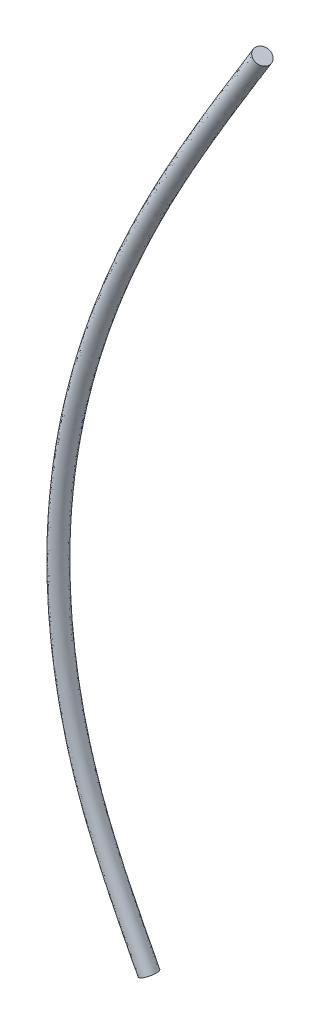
ISO-10303-21;
HEADER;
FILE_DESCRIPTION(('STEP AP214'),'2;1');
FILE_NAME('part.step','',(''),(''),'','','');
FILE_SCHEMA(('AUTOMOTIVE_DESIGN { 1 0 10303 214 1 1 1 1 }'));
ENDSEC;
DATA;
#1=APPLICATION_CONTEXT('core data for automotive mechanical design processes');
#2=APPLICATION_PROTOCOL_DEFINITION('international standard','automotive_design',2000,#1);
#3=PRODUCT_CONTEXT('',#1,'mechanical');
#4=PRODUCT('Part','Part','',(#3));
#5=PRODUCT_RELATED_PRODUCT_CATEGORY('part','',(#4));
#6=PRODUCT_DEFINITION_FORMATION('','',#4);
#7=PRODUCT_DEFINITION_CONTEXT('part definition',#1,'design');
#8=PRODUCT_DEFINITION('design','',#6,#7);
#9=PRODUCT_DEFINITION_SHAPE('','',#8);
#10=(LENGTH_UNIT() NAMED_UNIT(*) SI_UNIT(.MILLI.,.METRE.));
#11=(NAMED_UNIT(*) PLANE_ANGLE_UNIT() SI_UNIT($,.RADIAN.));
#12=(NAMED_UNIT(*) SI_UNIT($,.STERADIAN.) SOLID_ANGLE_UNIT());
#13=UNCERTAINTY_MEASURE_WITH_UNIT(LENGTH_MEASURE(1.E-05),#10,'distance_accuracy_value','');
#14=(GEOMETRIC_REPRESENTATION_CONTEXT(3) GLOBAL_UNCERTAINTY_ASSIGNED_CONTEXT((#13)) GLOBAL_UNIT_ASSIGNED_CONTEXT((#10,
#11,#12)) REPRESENTATION_CONTEXT('',''));
#15=CARTESIAN_POINT('',(0.,0.,0.));
#16=DIRECTION('',(0.,0.,1.));
#17=DIRECTION('',(1.,0.,0.));
#18=AXIS2_PLACEMENT_3D('',#15,#16,#17);
#19=CARTESIAN_POINT('',(418.325115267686,430.102678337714,0.));
#20=DIRECTION('',(-0.460967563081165,0.887416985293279,0.));
#21=DIRECTION('',(-0.887416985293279,-0.460967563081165,0.));
#22=AXIS2_PLACEMENT_3D('',#19,#20,#21);
#23=PLANE('',#22);
#24=CARTESIAN_POINT('',(418.325115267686,430.102678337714,0.));
#25=DIRECTION('',(-0.460967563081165,0.887416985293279,0.));
#26=DIRECTION('',(-0.887416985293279,-0.460967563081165,0.));
#27=AXIS2_PLACEMENT_3D('',#24,#25,#26);
#28=CIRCLE('',#27,0.799999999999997);
#29=CARTESIAN_POINT('',(417.615181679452,429.733904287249,0.));
#30=VERTEX_POINT('',#29);
#31=EDGE_CURVE('E47',#30,#30,#28,.T.);
#32=ORIENTED_EDGE('',*,*,#31,.F.);
#33=EDGE_LOOP('',(#32));
#34=FACE_BOUND('',#33,.T.);
#35=ADVANCED_FACE('F41',(#34),#23,.F.);
#36=CARTESIAN_POINT('',(429.430156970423,513.425412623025,0.));
#37=DIRECTION('',(0.523541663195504,0.852000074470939,0.));
#38=DIRECTION('',(-0.852000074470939,0.523541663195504,0.));
#39=AXIS2_PLACEMENT_3D('',#36,#37,#38);
#40=PLANE('',#39);
#41=CARTESIAN_POINT('',(429.430156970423,513.425412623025,0.));
#42=DIRECTION('',(0.523541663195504,0.852000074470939,0.));
#43=DIRECTION('',(-0.852000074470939,0.523541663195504,0.));
#44=AXIS2_PLACEMENT_3D('',#41,#42,#43);
#45=CIRCLE('',#44,0.799999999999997);
#46=CARTESIAN_POINT('',(428.748556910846,513.844245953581,0.));
#47=VERTEX_POINT('',#46);
#48=EDGE_CURVE('E11',#47,#47,#45,.T.);
#49=ORIENTED_EDGE('',*,*,#48,.T.);
#50=EDGE_LOOP('',(#49));
#51=FACE_BOUND('',#50,.T.);
#52=ADVANCED_FACE('F56',(#51),#40,.T.);
#53=CARTESIAN_POINT('',(417.615181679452,429.733904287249,0.));
#54=CARTESIAN_POINT('',(415.456880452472,433.888888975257,0.));
#55=CARTESIAN_POINT('',(413.278830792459,438.076232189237,0.));
#56=CARTESIAN_POINT('',(409.354520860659,449.218386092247,0.));
#57=CARTESIAN_POINT('',(408.382940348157,456.431332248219,0.));
#58=CARTESIAN_POINT('',(409.146415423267,472.229021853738,0.));
#59=CARTESIAN_POINT('',(411.543342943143,480.72406397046,0.));
#60=CARTESIAN_POINT('',(418.723152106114,497.534494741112,0.));
#61=CARTESIAN_POINT('',(423.747550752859,505.705719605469,0.));
#62=CARTESIAN_POINT('',(428.748556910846,513.844245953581,0.));
#63=CARTESIAN_POINT('',(417.615181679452,429.733904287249,1.59999999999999));
#64=CARTESIAN_POINT('',(415.456880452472,433.888888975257,1.59999999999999));
#65=CARTESIAN_POINT('',(413.278830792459,438.076232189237,1.59999999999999));
#66=CARTESIAN_POINT('',(409.354520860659,449.218386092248,1.59999999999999));
#67=CARTESIAN_POINT('',(408.382940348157,456.431332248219,1.59999999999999));
#68=CARTESIAN_POINT('',(409.146415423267,472.229021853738,1.59999999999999));
#69=CARTESIAN_POINT('',(411.543342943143,480.72406397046,1.59999999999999));
#70=CARTESIAN_POINT('',(418.723152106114,497.534494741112,1.59999999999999));
#71=CARTESIAN_POINT('',(423.747550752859,505.705719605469,1.59999999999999));
#72=CARTESIAN_POINT('',(428.748556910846,513.844245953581,1.59999999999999));
#73=CARTESIAN_POINT('',(419.035048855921,430.471452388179,1.59999999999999));
#74=CARTESIAN_POINT('',(416.876747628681,434.626437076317,1.59999999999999));
#75=CARTESIAN_POINT('',(414.738194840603,438.7490632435,1.59999999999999));
#76=CARTESIAN_POINT('',(410.937883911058,449.539151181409,1.59999999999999));
#77=CARTESIAN_POINT('',(409.990644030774,456.552095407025,1.59999999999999));
#78=CARTESIAN_POINT('',(410.732812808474,471.908918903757,1.59999999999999));
#79=CARTESIAN_POINT('',(413.06976486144,480.224413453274,1.59999999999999));
#80=CARTESIAN_POINT('',(420.133137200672,496.762225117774,1.59999999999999));
#81=CARTESIAN_POINT('',(425.110750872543,504.868052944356,1.59999999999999));
#82=CARTESIAN_POINT('',(430.11175703,513.006579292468,1.59999999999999));
#83=CARTESIAN_POINT('',(419.035048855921,430.471452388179,0.));
#84=CARTESIAN_POINT('',(416.876747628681,434.626437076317,0.));
#85=CARTESIAN_POINT('',(414.738194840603,438.7490632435,0.));
#86=CARTESIAN_POINT('',(410.937883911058,449.539151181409,0.));
#87=CARTESIAN_POINT('',(409.990644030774,456.552095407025,0.));
#88=CARTESIAN_POINT('',(410.732812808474,471.908918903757,0.));
#89=CARTESIAN_POINT('',(413.06976486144,480.224413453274,0.));
#90=CARTESIAN_POINT('',(420.133137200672,496.762225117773,0.));
#91=CARTESIAN_POINT('',(425.110750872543,504.868052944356,0.));
#92=CARTESIAN_POINT('',(430.11175703,513.006579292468,0.));
#93=CARTESIAN_POINT('',(419.035048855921,430.471452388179,-1.59999999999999));
#94=CARTESIAN_POINT('',(416.876747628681,434.626437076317,-1.59999999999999));
#95=CARTESIAN_POINT('',(414.738194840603,438.7490632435,-1.59999999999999));
#96=CARTESIAN_POINT('',(410.937883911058,449.539151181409,-1.59999999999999));
#97=CARTESIAN_POINT('',(409.990644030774,456.552095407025,-1.59999999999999));
#98=CARTESIAN_POINT('',(410.732812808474,471.908918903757,-1.59999999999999));
#99=CARTESIAN_POINT('',(413.06976486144,480.224413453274,-1.59999999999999));
#100=CARTESIAN_POINT('',(420.133137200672,496.762225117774,-1.59999999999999));
#101=CARTESIAN_POINT('',(425.110750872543,504.868052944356,-1.59999999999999));
#102=CARTESIAN_POINT('',(430.11175703,513.006579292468,-1.59999999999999));
#103=CARTESIAN_POINT('',(417.615181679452,429.733904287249,-1.59999999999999));
#104=CARTESIAN_POINT('',(415.456880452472,433.888888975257,-1.59999999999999));
#105=CARTESIAN_POINT('',(413.278830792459,438.076232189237,-1.59999999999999));
#106=CARTESIAN_POINT('',(409.354520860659,449.218386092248,-1.59999999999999));
#107=CARTESIAN_POINT('',(408.382940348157,456.431332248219,-1.59999999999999));
#108=CARTESIAN_POINT('',(409.146415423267,472.229021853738,-1.59999999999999));
#109=CARTESIAN_POINT('',(411.543342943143,480.72406397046,-1.59999999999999));
#110=CARTESIAN_POINT('',(418.723152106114,497.534494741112,-1.59999999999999));
#111=CARTESIAN_POINT('',(423.747550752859,505.705719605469,-1.59999999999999));
#112=CARTESIAN_POINT('',(428.748556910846,513.844245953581,-1.59999999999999));
#113=CARTESIAN_POINT('',(417.615181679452,429.733904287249,0.));
#114=CARTESIAN_POINT('',(415.456880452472,433.888888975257,0.));
#115=CARTESIAN_POINT('',(413.278830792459,438.076232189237,0.));
#116=CARTESIAN_POINT('',(409.354520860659,449.218386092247,0.));
#117=CARTESIAN_POINT('',(408.382940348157,456.431332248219,0.));
#118=CARTESIAN_POINT('',(409.146415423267,472.229021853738,0.));
#119=CARTESIAN_POINT('',(411.543342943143,480.72406397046,0.));
#120=CARTESIAN_POINT('',(418.723152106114,497.534494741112,0.));
#121=CARTESIAN_POINT('',(423.747550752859,505.705719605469,0.));
#122=CARTESIAN_POINT('',(428.748556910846,513.844245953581,0.));
#123=(BOUNDED_SURFACE() B_SPLINE_SURFACE(3,3,((#53,#54,#55,#56,#57,#58,#59,#60,#61,#62),(#63,
#64,#65,#66,#67,#68,#69,#70,#71,#72),(#73,#74,#75,#76,#77,#78,#79,#80,#81,#82),(#83,#84,#85,#86,
#87,#88,#89,#90,#91,#92),(#93,#94,#95,#96,#97,#98,#99,#100,#101,#102),(#103,#104,#105,#106,#107,
#108,#109,#110,#111,#112),(#113,#114,#115,#116,#117,#118,#119,#120,#121,#122)),.UNSPECIFIED.,
.T.,.F.,.F.) B_SPLINE_SURFACE_WITH_KNOTS((4,3,4),(4,2,2,2,4),(0.,0.5,1.),(0.,0.157137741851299,
0.391504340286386,0.678982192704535,1.),
.UNSPECIFIED.) GEOMETRIC_REPRESENTATION_ITEM() RATIONAL_B_SPLINE_SURFACE(((1.,1.,1.,1.,1.,1.,1.,
1.,1.,1.),(0.333333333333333,0.333333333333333,0.333333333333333,0.333333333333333,
0.333333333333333,0.333333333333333,0.333333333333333,0.333333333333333,0.333333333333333,
0.333333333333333),(0.333333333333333,0.333333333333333,0.333333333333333,0.333333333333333,
0.333333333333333,0.333333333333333,0.333333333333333,0.333333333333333,0.333333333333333,
0.333333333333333),(1.,1.,1.,1.,1.,1.,1.,1.,1.,1.),(0.333333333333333,0.333333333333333,
0.333333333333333,0.333333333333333,0.333333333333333,0.333333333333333,0.333333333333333,
0.333333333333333,0.333333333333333,0.333333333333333),(0.333333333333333,0.333333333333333,
0.333333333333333,0.333333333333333,0.333333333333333,0.333333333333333,0.333333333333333,
0.333333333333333,0.333333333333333,0.333333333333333),(1.,1.,1.,1.,1.,1.,1.,1.,1.,1.))) REPRESENTATION_ITEM('') SURFACE());
#124=CARTESIAN_POINT('',(428.748556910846,513.844245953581,0.));
#125=CARTESIAN_POINT('',(428.718129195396,513.794728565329,0.));
#126=CARTESIAN_POINT('',(428.68770139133,513.745211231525,0.));
#127=CARTESIAN_POINT('',(428.62684461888,513.646173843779,0.));
#128=CARTESIAN_POINT('',(428.596415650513,513.596653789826,0.));
#129=CARTESIAN_POINT('',(428.535557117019,513.49761066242,0.));
#130=CARTESIAN_POINT('',(428.505127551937,513.44808758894,0.));
#131=CARTESIAN_POINT('',(428.44426839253,513.349038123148,0.));
#132=CARTESIAN_POINT('',(428.413838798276,513.299511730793,0.));
#133=CARTESIAN_POINT('',(428.352980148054,513.200455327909,0.));
#134=CARTESIAN_POINT('',(428.322551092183,513.150925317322,0.));
#135=CARTESIAN_POINT('',(428.261694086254,513.051861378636,0.));
#136=CARTESIAN_POINT('',(428.231266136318,513.002327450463,0.));
#137=CARTESIAN_POINT('',(428.170411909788,512.903255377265,0.));
#138=CARTESIAN_POINT('',(428.139985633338,512.853717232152,0.));
#139=CARTESIAN_POINT('',(428.079135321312,512.754636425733,0.));
#140=CARTESIAN_POINT('',(428.048711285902,512.705093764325,0.));
#141=CARTESIAN_POINT('',(427.987866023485,512.606003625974,0.));
#142=CARTESIAN_POINT('',(427.957444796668,512.556456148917,0.));
#143=CARTESIAN_POINT('',(427.896605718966,512.457356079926,0.));
#144=CARTESIAN_POINT('',(427.866187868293,512.407803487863,0.));
#145=CARTESIAN_POINT('',(427.805356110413,512.308692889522,0.));
#146=CARTESIAN_POINT('',(427.774942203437,512.259134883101,0.));
#147=CARTESIAN_POINT('',(427.714118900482,512.1600131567,0.));
#148=CARTESIAN_POINT('',(427.683709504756,512.110449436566,0.));
#149=CARTESIAN_POINT('',(427.622895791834,512.011315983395,0.));
#150=CARTESIAN_POINT('',(427.592491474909,511.961746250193,0.));
#151=CARTESIAN_POINT('',(427.531688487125,511.862600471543,0.));
#152=CARTESIAN_POINT('',(427.501289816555,511.813024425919,0.));
#153=CARTESIAN_POINT('',(427.440498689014,511.71386572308,0.));
#154=CARTESIAN_POINT('',(427.410106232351,511.664283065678,0.));
#155=CARTESIAN_POINT('',(427.349328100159,511.56511083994,0.));
#156=CARTESIAN_POINT('',(427.318942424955,511.515521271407,0.));
#157=CARTESIAN_POINT('',(427.258178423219,511.416334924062,0.));
#158=CARTESIAN_POINT('',(427.227800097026,511.366738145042,0.));
#159=CARTESIAN_POINT('',(427.167051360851,511.267537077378,0.));
#160=CARTESIAN_POINT('',(427.136680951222,511.217932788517,0.));
#161=CARTESIAN_POINT('',(427.075948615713,511.118716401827,0.));
#162=CARTESIAN_POINT('',(427.045586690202,511.06910430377,0.));
#163=CARTESIAN_POINT('',(426.984871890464,510.969871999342,0.));
#164=CARTESIAN_POINT('',(426.954519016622,510.920251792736,0.));
#165=CARTESIAN_POINT('',(426.893822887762,510.821002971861,0.));
#166=CARTESIAN_POINT('',(426.863479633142,510.77137435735,0.));
#167=CARTESIAN_POINT('',(426.802803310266,510.672108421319,0.));
#168=CARTESIAN_POINT('',(426.77247024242,510.622471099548,0.));
#169=CARTESIAN_POINT('',(426.711814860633,510.52318744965,0.));
#170=CARTESIAN_POINT('',(426.681492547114,510.473541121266,0.));
#171=CARTESIAN_POINT('',(426.620859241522,510.374239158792,0.));
#172=CARTESIAN_POINT('',(426.590548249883,510.324583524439,0.));
#173=CARTESIAN_POINT('',(426.529938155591,510.22526265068,0.));
#174=CARTESIAN_POINT('',(426.499639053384,510.175597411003,0.));
#175=CARTESIAN_POINT('',(426.439053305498,510.076257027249,0.));
#176=CARTESIAN_POINT('',(426.408766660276,510.026581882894,0.));
#177=CARTESIAN_POINT('',(426.348206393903,509.927221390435,0.));
#178=CARTESIAN_POINT('',(426.317932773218,509.877536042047,0.));
#179=CARTESIAN_POINT('',(426.257399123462,509.778154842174,0.));
#180=CARTESIAN_POINT('',(426.227139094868,509.728458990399,0.));
#181=CARTESIAN_POINT('',(426.166633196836,509.629056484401,0.));
#182=CARTESIAN_POINT('',(426.136387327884,509.579349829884,0.));
#183=CARTESIAN_POINT('',(426.075910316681,509.479925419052,0.));
#184=CARTESIAN_POINT('',(426.045679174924,509.430207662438,0.));
#185=CARTESIAN_POINT('',(425.985232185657,509.330760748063,0.));
#186=CARTESIAN_POINT('',(425.955016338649,509.281031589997,0.));
#187=CARTESIAN_POINT('',(425.894600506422,509.181561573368,0.));
#188=CARTESIAN_POINT('',(425.864400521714,509.131820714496,0.));
#189=CARTESIAN_POINT('',(425.804016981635,509.032326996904,0.));
#190=CARTESIAN_POINT('',(425.77383342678,508.982574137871,0.));
#191=CARTESIAN_POINT('',(425.713483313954,508.883056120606,0.));
#192=CARTESIAN_POINT('',(425.683316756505,508.833290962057,0.));
#193=CARTESIAN_POINT('',(425.623001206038,508.733748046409,0.));
#194=CARTESIAN_POINT('',(425.592852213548,508.68397028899,0.));
#195=CARTESIAN_POINT('',(425.532572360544,508.58440187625,0.));
#196=CARTESIAN_POINT('',(425.502441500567,508.534611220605,0.));
#197=CARTESIAN_POINT('',(425.442198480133,508.435016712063,0.));
#198=CARTESIAN_POINT('',(425.41208632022,508.385212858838,0.));
#199=CARTESIAN_POINT('',(425.351881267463,508.285591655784,0.));
#200=CARTESIAN_POINT('',(425.321788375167,508.235774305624,0.));
#201=CARTESIAN_POINT('',(425.261622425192,508.136125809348,0.));
#202=CARTESIAN_POINT('',(425.231549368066,508.086294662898,0.));
#203=CARTESIAN_POINT('',(425.171423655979,507.986618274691,0.));
#204=CARTESIAN_POINT('',(425.141371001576,507.936773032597,0.));
#205=CARTESIAN_POINT('',(425.081286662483,507.837068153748,0.));
#206=CARTESIAN_POINT('',(425.051254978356,507.787208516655,0.));
#207=CARTESIAN_POINT('',(424.991213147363,507.687474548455,0.));
#208=CARTESIAN_POINT('',(424.961203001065,507.637600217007,0.));
#209=CARTESIAN_POINT('',(424.901204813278,507.537836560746,0.));
#210=CARTESIAN_POINT('',(424.871216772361,507.487947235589,0.));
#211=CARTESIAN_POINT('',(424.811263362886,507.388153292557,0.));
#212=CARTESIAN_POINT('',(424.781297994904,507.338248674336,0.));
#213=CARTESIAN_POINT('',(424.721390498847,507.238423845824,0.));
#214=CARTESIAN_POINT('',(424.691448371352,507.188503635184,0.));
#215=CARTESIAN_POINT('',(424.631587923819,507.088647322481,0.));
#216=CARTESIAN_POINT('',(424.601669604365,507.038711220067,0.));
#217=CARTESIAN_POINT('',(424.541857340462,506.938822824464,0.));
#218=CARTESIAN_POINT('',(424.511963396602,506.888870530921,0.));
#219=CARTESIAN_POINT('',(424.452200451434,506.788949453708,0.));
#220=CARTESIAN_POINT('',(424.422331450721,506.738980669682,0.));
#221=CARTESIAN_POINT('',(424.362618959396,506.639026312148,0.));
#222=CARTESIAN_POINT('',(424.332775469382,506.589040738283,0.));
#223=CARTESIAN_POINT('',(424.273114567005,506.489052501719,0.));
#224=CARTESIAN_POINT('',(424.243297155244,506.439049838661,0.));
#225=CARTESIAN_POINT('',(424.183688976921,506.339027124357,0.));
#226=CARTESIAN_POINT('',(424.153898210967,506.28900707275,0.));
#227=CARTESIAN_POINT('',(424.094343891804,506.188949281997,0.));
#228=CARTESIAN_POINT('',(424.064580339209,506.138911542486,0.));
#229=CARTESIAN_POINT('',(424.005081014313,506.038818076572,0.));
#230=CARTESIAN_POINT('',(423.97534524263,505.988762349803,0.));
#231=CARTESIAN_POINT('',(423.915902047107,505.888632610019,0.));
#232=CARTESIAN_POINT('',(423.88619462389,505.838558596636,0.));
#233=CARTESIAN_POINT('',(423.826808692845,505.738391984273,0.));
#234=CARTESIAN_POINT('',(423.797130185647,505.688299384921,0.));
#235=CARTESIAN_POINT('',(423.737802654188,505.588095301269,0.));
#236=CARTESIAN_POINT('',(423.708153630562,505.537983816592,0.));
#237=CARTESIAN_POINT('',(423.648885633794,505.43774166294,0.));
#238=CARTESIAN_POINT('',(423.619266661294,505.387610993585,0.));
#239=CARTESIAN_POINT('',(423.560059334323,505.287330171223,0.));
#240=CARTESIAN_POINT('',(423.530470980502,505.237180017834,0.));
#241=CARTESIAN_POINT('',(423.471325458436,505.136859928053,0.));
#242=CARTESIAN_POINT('',(423.441768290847,505.086689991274,0.));
#243=CARTESIAN_POINT('',(423.38268570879,504.986330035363,0.));
#244=CARTESIAN_POINT('',(423.353160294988,504.936140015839,0.));
#245=CARTESIAN_POINT('',(423.294141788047,504.835739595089,0.));
#246=CARTESIAN_POINT('',(423.264648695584,504.785529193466,0.));
#247=CARTESIAN_POINT('',(423.205695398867,504.685087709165,0.));
#248=CARTESIAN_POINT('',(423.176235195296,504.634856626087,0.));
#249=CARTESIAN_POINT('',(423.117348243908,504.534373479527,0.));
#250=CARTESIAN_POINT('',(423.087921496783,504.484121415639,0.));
#251=CARTESIAN_POINT('',(423.029102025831,504.383596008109,0.));
#252=CARTESIAN_POINT('',(422.999709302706,504.333322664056,0.));
#253=CARTESIAN_POINT('',(422.940958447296,504.232754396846,0.));
#254=CARTESIAN_POINT('',(422.911600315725,504.182459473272,0.));
#255=CARTESIAN_POINT('',(422.852919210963,504.081847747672,0.));
#256=CARTESIAN_POINT('',(422.8235962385,504.031530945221,0.));
#257=CARTESIAN_POINT('',(422.764986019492,503.930875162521,0.));
#258=CARTESIAN_POINT('',(422.73569877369,503.88053618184,0.));
#259=CARTESIAN_POINT('',(422.677160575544,503.779835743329,0.));
#260=CARTESIAN_POINT('',(422.647909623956,503.729474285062,0.));
#261=CARTESIAN_POINT('',(422.589444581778,503.628728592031,0.));
#262=CARTESIAN_POINT('',(422.560230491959,503.578344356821,0.));
#263=CARTESIAN_POINT('',(422.501839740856,503.47755281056,0.));
#264=CARTESIAN_POINT('',(422.472663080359,503.427145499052,0.));
#265=CARTESIAN_POINT('',(422.414347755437,503.32630750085,0.));
#266=CARTESIAN_POINT('',(422.385209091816,503.27587681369,0.));
#267=CARTESIAN_POINT('',(422.326970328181,503.174991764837,0.));
#268=CARTESIAN_POINT('',(422.297870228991,503.124537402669,0.));
#269=CARTESIAN_POINT('',(422.23970916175,503.023604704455,0.));
#270=CARTESIAN_POINT('',(422.210648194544,502.973126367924,0.));
#271=CARTESIAN_POINT('',(422.152565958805,502.872145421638,0.));
#272=CARTESIAN_POINT('',(422.123544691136,502.821642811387,0.));
#273=CARTESIAN_POINT('',(422.065542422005,502.72061301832,0.));
#274=CARTESIAN_POINT('',(422.036561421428,502.670085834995,0.));
#275=CARTESIAN_POINT('',(421.978640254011,502.569006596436,0.));
#276=CARTESIAN_POINT('',(421.949700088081,502.518454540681,0.));
#277=CARTESIAN_POINT('',(421.891861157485,502.41732525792,0.));
#278=CARTESIAN_POINT('',(421.862962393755,502.36674803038,0.));
#279=CARTESIAN_POINT('',(421.805206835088,502.265568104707,0.));
#280=CARTESIAN_POINT('',(421.776350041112,502.214965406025,0.));
#281=CARTESIAN_POINT('',(421.718678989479,502.113734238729,0.));
#282=CARTESIAN_POINT('',(421.689864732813,502.063105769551,0.));
#283=CARTESIAN_POINT('',(421.632279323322,501.961822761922,0.));
#284=CARTESIAN_POINT('',(421.603508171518,501.911168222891,0.));
#285=CARTESIAN_POINT('',(421.546009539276,501.80983277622,0.));
#286=CARTESIAN_POINT('',(421.517282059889,501.759151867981,0.));
#287=CARTESIAN_POINT('',(421.459871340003,501.657763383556,0.));
#288=CARTESIAN_POINT('',(421.431188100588,501.607055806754,0.));
#289=CARTESIAN_POINT('',(421.373866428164,501.505613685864,0.));
#290=CARTESIAN_POINT('',(421.345227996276,501.454879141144,0.));
#291=CARTESIAN_POINT('',(421.287996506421,501.35338278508,0.));
#292=CARTESIAN_POINT('',(421.259403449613,501.302620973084,0.));
#293=CARTESIAN_POINT('',(421.202263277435,501.201069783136,0.));
#294=CARTESIAN_POINT('',(421.173716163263,501.15028040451,0.));
#295=CARTESIAN_POINT('',(421.116668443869,501.048673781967,0.));
#296=CARTESIAN_POINT('',(421.088167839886,500.997856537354,0.));
#297=CARTESIAN_POINT('',(421.031213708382,500.896193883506,0.));
#298=CARTESIAN_POINT('',(421.002760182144,500.845348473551,0.));
#299=CARTESIAN_POINT('',(420.945900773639,500.743629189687,0.));
#300=CARTESIAN_POINT('',(420.9174948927,500.692755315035,0.));
#301=CARTESIAN_POINT('',(420.860731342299,500.590978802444,0.));
#302=CARTESIAN_POINT('',(420.832373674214,500.540076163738,0.));
#303=CARTESIAN_POINT('',(420.775707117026,500.438241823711,0.));
#304=CARTESIAN_POINT('',(420.74739822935,500.387310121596,0.));
#305=CARTESIAN_POINT('',(420.690829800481,500.285417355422,0.));
#306=CARTESIAN_POINT('',(420.662570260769,500.234456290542,0.));
#307=CARTESIAN_POINT('',(420.606101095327,500.13250449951,0.));
#308=CARTESIAN_POINT('',(420.577891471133,500.081513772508,0.));
#309=CARTESIAN_POINT('',(420.521522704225,499.979502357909,0.));
#310=CARTESIAN_POINT('',(420.493363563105,499.92848166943,0.));
#311=CARTESIAN_POINT('',(420.437096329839,499.826410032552,0.));
#312=CARTESIAN_POINT('',(420.408988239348,499.775359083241,0.));
#313=CARTESIAN_POINT('',(420.352823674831,499.673226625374,0.));
#314=CARTESIAN_POINT('',(420.324767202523,499.622145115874,0.));
#315=CARTESIAN_POINT('',(420.268706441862,499.519951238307,0.));
#316=CARTESIAN_POINT('',(420.240702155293,499.468838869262,0.));
#317=CARTESIAN_POINT('',(420.184746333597,499.366582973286,0.));
#318=CARTESIAN_POINT('',(420.156794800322,499.31543944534,0.));
#319=CARTESIAN_POINT('',(420.100945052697,499.213120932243,0.));
#320=CARTESIAN_POINT('',(420.073046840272,499.161945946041,0.));
#321=CARTESIAN_POINT('',(420.017304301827,499.059564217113,0.));
#322=CARTESIAN_POINT('',(419.989459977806,499.008357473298,0.));
#323=CARTESIAN_POINT('',(419.933825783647,498.905911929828,0.));
#324=CARTESIAN_POINT('',(419.906035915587,498.854673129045,0.));
#325=CARTESIAN_POINT('',(419.850511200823,498.752163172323,0.));
#326=CARTESIAN_POINT('',(419.822776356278,498.700892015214,0.));
#327=CARTESIAN_POINT('',(419.767362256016,498.598317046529,0.));
#328=CARTESIAN_POINT('',(419.739683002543,498.54701323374,0.));
#329=CARTESIAN_POINT('',(419.684380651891,498.444372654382,0.));
#330=CARTESIAN_POINT('',(419.656757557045,498.393035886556,0.));
#331=CARTESIAN_POINT('',(419.601568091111,498.290329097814,0.));
#332=CARTESIAN_POINT('',(419.574001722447,498.238959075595,0.));
#333=CARTESIAN_POINT('',(419.518926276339,498.136185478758,0.));
#334=CARTESIAN_POINT('',(419.491417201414,498.08478190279,0.));
#335=CARTESIAN_POINT('',(419.436456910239,497.981940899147,0.));
#336=CARTESIAN_POINT('',(419.409005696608,497.930503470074,0.));
#337=CARTESIAN_POINT('',(419.354161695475,497.827594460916,0.));
#338=CARTESIAN_POINT('',(419.326768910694,497.776122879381,0.));
#339=CARTESIAN_POINT('',(419.27204233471,497.673145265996,0.));
#340=CARTESIAN_POINT('',(419.244708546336,497.621639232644,0.));
#341=CARTESIAN_POINT('',(419.19010053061,497.518592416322,0.));
#342=CARTESIAN_POINT('',(419.162826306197,497.467051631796,0.));
#343=CARTESIAN_POINT('',(419.108337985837,497.363935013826,0.));
#344=CARTESIAN_POINT('',(419.081123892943,497.312359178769,0.));
#345=CARTESIAN_POINT('',(419.026756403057,497.209172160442,0.));
#346=CARTESIAN_POINT('',(418.999603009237,497.157560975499,0.));
#347=CARTESIAN_POINT('',(418.945357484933,497.054302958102,0.));
#348=CARTESIAN_POINT('',(418.918265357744,497.002656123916,0.));
#349=CARTESIAN_POINT('',(418.86414293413,496.899326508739,0.));
#350=CARTESIAN_POINT('',(418.837112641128,496.847643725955,0.));
#351=CARTESIAN_POINT('',(418.783114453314,496.744241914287,0.));
#352=CARTESIAN_POINT('',(418.756146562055,496.692522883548,0.));
#353=CARTESIAN_POINT('',(418.702273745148,496.589048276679,0.));
#354=CARTESIAN_POINT('',(418.675368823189,496.537292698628,0.));
#355=CARTESIAN_POINT('',(418.621622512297,496.433744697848,0.));
#356=CARTESIAN_POINT('',(418.594781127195,496.381952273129,0.));
#357=CARTESIAN_POINT('',(418.541162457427,496.278330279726,0.));
#358=CARTESIAN_POINT('',(418.514385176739,496.226500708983,0.));
#359=CARTESIAN_POINT('',(418.460895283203,496.122804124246,0.));
#360=CARTESIAN_POINT('',(418.434182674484,496.070937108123,0.));
#361=CARTESIAN_POINT('',(418.38082269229,495.967165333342,0.));
#362=CARTESIAN_POINT('',(418.354175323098,495.915260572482,0.));
#363=CARTESIAN_POINT('',(418.300946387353,495.811413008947,0.));
#364=CARTESIAN_POINT('',(418.274364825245,495.759470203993,0.));
#365=CARTESIAN_POINT('',(418.221268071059,495.655546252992,0.));
#366=CARTESIAN_POINT('',(418.194752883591,495.603565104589,0.));
#367=CARTESIAN_POINT('',(418.141789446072,495.499564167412,0.));
#368=CARTESIAN_POINT('',(418.115341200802,495.447544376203,0.));
#369=CARTESIAN_POINT('',(418.06251221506,495.343465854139,0.));
#370=CARTESIAN_POINT('',(418.036131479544,495.291407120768,0.));
#371=CARTESIAN_POINT('',(417.983438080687,495.187250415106,0.));
#372=CARTESIAN_POINT('',(417.957125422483,495.135152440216,0.));
#373=CARTESIAN_POINT('',(417.904568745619,495.030916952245,0.));
#374=CARTESIAN_POINT('',(417.878324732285,494.97877943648,0.));
#375=CARTESIAN_POINT('',(417.825905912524,494.87446456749,0.));
#376=CARTESIAN_POINT('',(417.799731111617,494.822287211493,0.));
#377=CARTESIAN_POINT('',(417.747451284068,494.717892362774,0.));
#378=CARTESIAN_POINT('',(417.721346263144,494.665674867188,0.));
#379=CARTESIAN_POINT('',(417.669206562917,494.561199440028,0.));
#380=CARTESIAN_POINT('',(417.643171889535,494.508941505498,0.));
#381=CARTESIAN_POINT('',(417.591173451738,494.404384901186,0.));
#382=CARTESIAN_POINT('',(417.565209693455,494.352086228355,0.));
#383=CARTESIAN_POINT('',(417.513353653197,494.247447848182,0.));
#384=CARTESIAN_POINT('',(417.487461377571,494.195108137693,0.));
#385=CARTESIAN_POINT('',(417.435748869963,494.090387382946,0.));
#386=CARTESIAN_POINT('',(417.409928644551,494.038006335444,0.));
#387=CARTESIAN_POINT('',(417.358360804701,493.933202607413,0.));
#388=CARTESIAN_POINT('',(417.332613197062,493.88077992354,0.));
#389=CARTESIAN_POINT('',(417.28119116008,493.775892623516,0.));
#390=CARTESIAN_POINT('',(417.255516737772,493.723428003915,0.));
#391=CARTESIAN_POINT('',(417.204241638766,493.618456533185,0.));
#392=CARTESIAN_POINT('',(417.178640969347,493.565949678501,0.));
#393=CARTESIAN_POINT('',(417.127513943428,493.460893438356,0.));
#394=CARTESIAN_POINT('',(417.101987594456,493.408344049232,0.));
#395=CARTESIAN_POINT('',(417.051009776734,493.30320244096,0.));
#396=CARTESIAN_POINT('',(417.025558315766,493.25061021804,0.));
#397=CARTESIAN_POINT('',(416.97473084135,493.14538264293,0.));
#398=CARTESIAN_POINT('',(416.949354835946,493.092747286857,0.));
#399=CARTESIAN_POINT('',(416.898678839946,492.9874331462,0.));
#400=CARTESIAN_POINT('',(416.873378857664,492.934754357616,0.));
#401=CARTESIAN_POINT('',(416.822855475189,492.829353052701,0.));
#402=CARTESIAN_POINT('',(416.797632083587,492.776630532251,0.));
#403=CARTESIAN_POINT('',(416.747262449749,492.671141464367,0.));
#404=CARTESIAN_POINT('',(416.722116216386,492.618374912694,0.));
#405=CARTESIAN_POINT('',(416.671901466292,492.51279748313,0.));
#406=CARTESIAN_POINT('',(416.646832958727,492.459986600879,0.));
#407=CARTESIAN_POINT('',(416.59677422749,492.354320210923,0.));
#408=CARTESIAN_POINT('',(416.571784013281,492.301464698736,0.));
#409=CARTESIAN_POINT('',(416.521882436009,492.19570874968,0.));
#410=CARTESIAN_POINT('',(416.496971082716,492.142808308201,0.));
#411=CARTESIAN_POINT('',(416.44722779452,492.036962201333,0.));
#412=CARTESIAN_POINT('',(416.422395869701,491.984016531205,0.));
#413=CARTESIAN_POINT('',(416.372812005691,491.878079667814,0.));
#414=CARTESIAN_POINT('',(416.348060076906,491.825088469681,0.));
#415=CARTESIAN_POINT('',(416.298636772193,491.719060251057,0.));
#416=CARTESIAN_POINT('',(416.273965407,491.666023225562,0.));
#417=CARTESIAN_POINT('',(416.224703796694,491.559903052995,0.));
#418=CARTESIAN_POINT('',(416.200113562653,491.506819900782,0.));
#419=CARTESIAN_POINT('',(416.151014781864,491.40060717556,0.));
#420=CARTESIAN_POINT('',(416.126506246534,491.347477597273,0.));
#421=CARTESIAN_POINT('',(416.077571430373,491.241171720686,0.));
#422=CARTESIAN_POINT('',(416.053145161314,491.187995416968,0.));
#423=CARTESIAN_POINT('',(416.004375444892,491.081595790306,0.));
#424=CARTESIAN_POINT('',(415.980032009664,491.0283724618,0.));
#425=CARTESIAN_POINT('',(415.93142852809,490.921878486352,0.));
#426=CARTESIAN_POINT('',(415.907168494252,490.868607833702,0.));
#427=CARTESIAN_POINT('',(415.858732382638,490.762018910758,0.));
#428=CARTESIAN_POINT('',(415.83455631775,490.708700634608,0.));
#429=CARTESIAN_POINT('',(415.786288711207,490.602016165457,0.));
#430=CARTESIAN_POINT('',(415.762197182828,490.54864996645,0.));
#431=CARTESIAN_POINT('',(415.714099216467,490.441869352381,0.));
#432=CARTESIAN_POINT('',(415.690092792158,490.388454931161,0.));
#433=CARTESIAN_POINT('',(415.64216560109,490.281577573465,0.));
#434=CARTESIAN_POINT('',(415.61824484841,490.228114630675,0.));
#435=CARTESIAN_POINT('',(415.570489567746,490.121139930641,0.));
#436=CARTESIAN_POINT('',(415.546655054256,490.067628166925,0.));
#437=CARTESIAN_POINT('',(415.499072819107,489.960555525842,0.));
#438=CARTESIAN_POINT('',(415.475325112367,489.906994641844,0.));
#439=CARTESIAN_POINT('',(415.427917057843,489.799823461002,0.));
#440=CARTESIAN_POINT('',(415.404256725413,489.746213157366,0.));
#441=CARTESIAN_POINT('',(415.35702398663,489.638942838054,0.));
#442=CARTESIAN_POINT('',(415.333451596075,489.585282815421,0.));
#443=CARTESIAN_POINT('',(415.286395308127,489.477912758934,0.));
#444=CARTESIAN_POINT('',(415.262911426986,489.424202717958,0.));
#445=CARTESIAN_POINT('',(415.216032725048,489.31673232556,0.));
#446=CARTESIAN_POINT('',(415.192637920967,489.262971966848,0.));
#447=CARTESIAN_POINT('',(415.145937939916,489.155400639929,0.));
#448=CARTESIAN_POINT('',(415.122632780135,489.101589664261,0.));
#449=CARTESIAN_POINT('',(415.076112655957,488.993916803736,0.));
#450=CARTESIAN_POINT('',(415.052897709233,488.940054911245,0.));
#451=CARTESIAN_POINT('',(415.006558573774,488.832279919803,0.));
#452=CARTESIAN_POINT('',(414.983434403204,488.778366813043,0.));
#453=CARTESIAN_POINT('',(414.937277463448,488.670489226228,0.));
#454=CARTESIAN_POINT('',(414.914244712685,488.616524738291,0.));
#455=CARTESIAN_POINT('',(414.868271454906,488.508544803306,0.));
#456=CARTESIAN_POINT('',(414.845330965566,488.454529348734,0.));
#457=CARTESIAN_POINT('',(414.799542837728,488.346447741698,0.));
#458=CARTESIAN_POINT('',(414.77669521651,488.292381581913,0.));
#459=CARTESIAN_POINT('',(414.731093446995,488.184198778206,0.));
#460=CARTESIAN_POINT('',(414.708339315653,488.130082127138,0.));
#461=CARTESIAN_POINT('',(414.662925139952,488.021798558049,0.));
#462=CARTESIAN_POINT('',(414.640265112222,487.967631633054,0.));
#463=CARTESIAN_POINT('',(414.595039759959,487.859247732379,0.));
#464=CARTESIAN_POINT('',(414.572474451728,487.805030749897,0.));
#465=CARTESIAN_POINT('',(414.527439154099,487.696546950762,0.));
#466=CARTESIAN_POINT('',(414.504969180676,487.642280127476,0.));
#467=CARTESIAN_POINT('',(414.460125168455,487.533696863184,0.));
#468=CARTESIAN_POINT('',(414.437751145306,487.479380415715,0.));
#469=CARTESIAN_POINT('',(414.39309964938,487.370698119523,0.));
#470=CARTESIAN_POINT('',(414.370822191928,487.316332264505,0.));
#471=CARTESIAN_POINT('',(414.326364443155,487.207551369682,0.));
#472=CARTESIAN_POINT('',(414.304184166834,487.153136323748,0.));
#473=CARTESIAN_POINT('',(414.259921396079,487.04425726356,0.));
#474=CARTESIAN_POINT('',(414.237838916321,486.989793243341,0.));
#475=CARTESIAN_POINT('',(414.193772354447,486.880816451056,0.));
#476=CARTESIAN_POINT('',(414.171788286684,486.826303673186,0.));
#477=CARTESIAN_POINT('',(414.127919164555,486.717229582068,0.));
#478=CARTESIAN_POINT('',(414.10603412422,486.662668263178,0.));
#479=CARTESIAN_POINT('',(414.0623636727,486.553497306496,0.));
#480=CARTESIAN_POINT('',(414.040578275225,486.498887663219,0.));
#481=CARTESIAN_POINT('',(413.997107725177,486.389620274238,0.));
#482=CARTESIAN_POINT('',(413.975422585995,486.334962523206,0.));
#483=CARTESIAN_POINT('',(413.932153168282,486.225599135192,0.));
#484=CARTESIAN_POINT('',(413.910568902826,486.170893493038,0.));
#485=CARTESIAN_POINT('',(413.867501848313,486.061434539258,0.));
#486=CARTESIAN_POINT('',(413.846019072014,486.006681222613,0.));
#487=CARTESIAN_POINT('',(413.803155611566,485.897127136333,0.));
#488=CARTESIAN_POINT('',(413.781774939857,485.84232636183,0.));
#489=CARTESIAN_POINT('',(413.739116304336,485.732677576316,0.));
#490=CARTESIAN_POINT('',(413.717838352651,485.677829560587,0.));
#491=CARTESIAN_POINT('',(413.675385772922,485.568086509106,0.));
#492=CARTESIAN_POINT('',(413.654211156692,485.513191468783,0.));
#493=CARTESIAN_POINT('',(413.611965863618,485.403354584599,0.));
#494=CARTESIAN_POINT('',(413.590895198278,485.348412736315,0.));
#495=CARTESIAN_POINT('',(413.548858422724,485.238482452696,0.));
#496=CARTESIAN_POINT('',(413.527892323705,485.183494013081,0.));
#497=CARTESIAN_POINT('',(413.486065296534,485.073470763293,0.));
#498=CARTESIAN_POINT('',(413.46520437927,485.018435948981,0.));
#499=CARTESIAN_POINT('',(413.423588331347,484.908320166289,0.));
#500=CARTESIAN_POINT('',(413.402833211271,484.853239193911,0.));
#501=CARTESIAN_POINT('',(413.36142937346,484.743031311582,0.));
#502=CARTESIAN_POINT('',(413.340780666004,484.68790439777,0.));
#503=CARTESIAN_POINT('',(413.29959026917,484.577604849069,0.));
#504=CARTESIAN_POINT('',(413.279048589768,484.522432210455,0.));
#505=CARTESIAN_POINT('',(413.238072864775,484.412041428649,0.));
#506=CARTESIAN_POINT('',(413.21763882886,484.356823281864,0.));
#507=CARTESIAN_POINT('',(413.176879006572,484.246341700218,0.));
#508=CARTESIAN_POINT('',(413.156553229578,484.191078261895,0.));
#509=CARTESIAN_POINT('',(413.116010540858,484.080506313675,0.));
#510=CARTESIAN_POINT('',(413.095793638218,484.025197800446,0.));
#511=CARTESIAN_POINT('',(413.055469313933,483.914535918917,0.));
#512=CARTESIAN_POINT('',(413.03536190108,483.859182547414,0.));
#513=CARTESIAN_POINT('',(412.995257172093,483.748431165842,0.));
#514=CARTESIAN_POINT('',(412.975259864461,483.693033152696,0.));
#515=CARTESIAN_POINT('',(412.935375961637,483.582192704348,0.));
#516=CARTESIAN_POINT('',(412.915489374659,483.52675026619,0.));
#517=CARTESIAN_POINT('',(412.875827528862,483.41582118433,0.));
#518=CARTESIAN_POINT('',(412.856052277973,483.360334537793,0.));
#519=CARTESIAN_POINT('',(412.816613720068,483.249317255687,0.));
#520=CARTESIAN_POINT('',(412.796950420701,483.193786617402,0.));
#521=CARTESIAN_POINT('',(412.757736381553,483.082681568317,0.));
#522=CARTESIAN_POINT('',(412.738185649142,483.027107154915,0.));
#523=CARTESIAN_POINT('',(412.699197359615,482.915914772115,0.));
#524=CARTESIAN_POINT('',(412.679759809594,482.860296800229,0.));
#525=CARTESIAN_POINT('',(412.640998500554,482.74901751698,0.));
#526=CARTESIAN_POINT('',(412.621674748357,482.693356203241,0.));
#527=CARTESIAN_POINT('',(412.583141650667,482.581990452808,0.));
#528=CARTESIAN_POINT('',(412.563932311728,482.526286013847,0.));
#529=CARTESIAN_POINT('',(412.525628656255,482.414834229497,0.));
#530=CARTESIAN_POINT('',(412.506534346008,482.359086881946,0.));
#531=CARTESIAN_POINT('',(412.468461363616,482.247549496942,0.));
#532=CARTESIAN_POINT('',(412.449482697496,482.191759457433,0.));
#533=CARTESIAN_POINT('',(412.41164161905,482.080136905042,0.));
#534=CARTESIAN_POINT('',(412.39277921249,482.024304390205,0.));
#535=CARTESIAN_POINT('',(412.355171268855,481.912597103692,0.));
#536=CARTESIAN_POINT('',(412.336425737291,481.856722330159,0.));
#537=CARTESIAN_POINT('',(412.299052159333,481.744930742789,0.));
#538=CARTESIAN_POINT('',(412.280424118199,481.689013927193,0.));
#539=CARTESIAN_POINT('',(412.243286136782,481.577138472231,0.));
#540=CARTESIAN_POINT('',(412.224776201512,481.521179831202,0.));
#541=CARTESIAN_POINT('',(412.187875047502,481.409220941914,0.));
#542=CARTESIAN_POINT('',(412.169483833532,481.353220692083,0.));
#543=CARTESIAN_POINT('',(412.132820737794,481.241178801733,0.));
#544=CARTESIAN_POINT('',(412.114548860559,481.185137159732,0.));
#545=CARTESIAN_POINT('',(412.078125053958,481.073012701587,0.));
#546=CARTESIAN_POINT('',(412.059973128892,481.016929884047,0.));
#547=CARTESIAN_POINT('',(412.023789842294,480.904723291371,0.));
#548=CARTESIAN_POINT('',(412.005758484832,480.848599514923,0.));
#549=CARTESIAN_POINT('',(411.969816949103,480.736311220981,0.));
#550=CARTESIAN_POINT('',(411.95190677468,480.680146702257,0.));
#551=CARTESIAN_POINT('',(411.916208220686,480.567777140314,0.));
#552=CARTESIAN_POINT('',(411.898419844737,480.511572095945,0.));
#553=CARTESIAN_POINT('',(411.862965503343,480.399121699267,0.));
#554=CARTESIAN_POINT('',(411.845299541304,480.342876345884,0.));
#555=CARTESIAN_POINT('',(411.810090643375,480.230345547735,0.));
#556=CARTESIAN_POINT('',(411.792547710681,480.174060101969,0.));
#557=CARTESIAN_POINT('',(411.757585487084,480.061449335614,0.));
#558=CARTESIAN_POINT('',(411.740166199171,480.005124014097,0.));
#559=CARTESIAN_POINT('',(411.705451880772,479.892433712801,0.));
#560=CARTESIAN_POINT('',(411.688156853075,479.836068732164,0.));
#561=CARTESIAN_POINT('',(411.653691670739,479.723299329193,0.));
#562=CARTESIAN_POINT('',(411.636521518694,479.666894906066,0.));
#563=CARTESIAN_POINT('',(411.602306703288,479.554046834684,0.));
#564=CARTESIAN_POINT('',(411.585262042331,479.497603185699,0.));
#565=CARTESIAN_POINT('',(411.55129882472,479.384676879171,0.));
#566=CARTESIAN_POINT('',(411.534380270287,479.328194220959,0.));
#567=CARTESIAN_POINT('',(411.500669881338,479.21519011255,0.));
#568=CARTESIAN_POINT('',(411.483878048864,479.158668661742,0.));
#569=CARTESIAN_POINT('',(411.450421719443,479.045587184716,0.));
#570=CARTESIAN_POINT('',(411.433757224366,478.989027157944,0.));
#571=CARTESIAN_POINT('',(411.400556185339,478.875868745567,0.));
#572=CARTESIAN_POINT('',(411.384019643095,478.819270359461,0.));
#573=CARTESIAN_POINT('',(411.351075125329,478.706035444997,0.));
#574=CARTESIAN_POINT('',(411.334667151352,478.649398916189,0.));
#575=CARTESIAN_POINT('',(411.301980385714,478.536087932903,0.));
#576=CARTESIAN_POINT('',(411.285701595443,478.479413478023,0.));
#577=CARTESIAN_POINT('',(411.253273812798,478.366026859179,0.));
#578=CARTESIAN_POINT('',(411.237124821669,478.309314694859,0.));
#579=CARTESIAN_POINT('',(411.204957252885,478.195852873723,0.));
#580=CARTESIAN_POINT('',(411.188938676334,478.139103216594,0.));
#581=CARTESIAN_POINT('',(411.157032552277,478.02556662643,0.));
#582=CARTESIAN_POINT('',(411.141145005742,477.968779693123,0.));
#583=CARTESIAN_POINT('',(411.109501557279,477.855168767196,0.));
#584=CARTESIAN_POINT('',(411.093745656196,477.798344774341,0.));
#585=CARTESIAN_POINT('',(411.062366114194,477.684659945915,0.));
#586=CARTESIAN_POINT('',(411.046742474,477.627799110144,0.));
#587=CARTESIAN_POINT('',(411.015628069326,477.514040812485,0.));
#588=CARTESIAN_POINT('',(411.000137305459,477.457143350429,0.));
#589=CARTESIAN_POINT('',(410.96928926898,477.3433120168,0.));
#590=CARTESIAN_POINT('',(410.953931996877,477.286378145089,0.));
#591=CARTESIAN_POINT('',(410.92335155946,477.172474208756,0.));
#592=CARTESIAN_POINT('',(410.908128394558,477.115504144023,0.));
#593=CARTESIAN_POINT('',(410.87781678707,477.00152803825,0.));
#594=CARTESIAN_POINT('',(410.862728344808,476.944521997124,0.));
#595=CARTESIAN_POINT('',(410.832686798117,476.830474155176,0.));
#596=CARTESIAN_POINT('',(410.817733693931,476.773432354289,0.));
#597=CARTESIAN_POINT('',(410.787963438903,476.65931320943,0.));
#598=CARTESIAN_POINT('',(410.773146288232,476.602235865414,0.));
#599=CARTESIAN_POINT('',(410.743648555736,476.488045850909,0.));
#600=CARTESIAN_POINT('',(410.728967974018,476.430933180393,0.));
#601=CARTESIAN_POINT('',(410.699743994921,476.316672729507,0.));
#602=CARTESIAN_POINT('',(410.685200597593,476.259524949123,0.));
#603=CARTESIAN_POINT('',(410.656251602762,476.145194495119,0.));
#604=CARTESIAN_POINT('',(410.641846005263,476.088011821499,0.));
#605=CARTESIAN_POINT('',(410.613173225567,475.973611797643,0.));
#606=CARTESIAN_POINT('',(410.598906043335,475.916394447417,0.));
#607=CARTESIAN_POINT('',(410.570510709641,475.801925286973,0.));
#608=CARTESIAN_POINT('',(410.556382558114,475.744673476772,0.));
#609=CARTESIAN_POINT('',(410.528265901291,475.630135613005,0.));
#610=CARTESIAN_POINT('',(410.514277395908,475.572849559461,0.));
#611=CARTESIAN_POINT('',(410.486440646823,475.458243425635,0.));
#612=CARTESIAN_POINT('',(410.472592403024,475.400923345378,0.));
#613=CARTESIAN_POINT('',(410.445036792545,475.286249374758,0.));
#614=CARTESIAN_POINT('',(410.431329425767,475.22889548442,0.));
#615=CARTESIAN_POINT('',(410.404056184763,475.114154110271,0.));
#616=CARTESIAN_POINT('',(410.390490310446,475.056766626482,0.));
#617=CARTESIAN_POINT('',(410.363500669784,474.941958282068,0.));
#618=CARTESIAN_POINT('',(410.350076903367,474.88453742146,0.));
#619=CARTESIAN_POINT('',(410.323372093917,474.769662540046,0.));
#620=CARTESIAN_POINT('',(410.310091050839,474.71220851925,0.));
#621=CARTESIAN_POINT('',(410.283672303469,474.5972675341,0.));
#622=CARTESIAN_POINT('',(410.27053459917,474.539780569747,0.));
#623=CARTESIAN_POINT('',(410.244403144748,474.424773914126,0.));
#624=CARTESIAN_POINT('',(410.231409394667,474.367254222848,0.));
#625=CARTESIAN_POINT('',(410.205566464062,474.25218233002,0.));
#626=CARTESIAN_POINT('',(410.192717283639,474.194630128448,0.));
#627=CARTESIAN_POINT('',(410.16716410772,474.079493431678,0.));
#628=CARTESIAN_POINT('',(410.154460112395,474.021908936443,0.));
#629=CARTESIAN_POINT('',(410.12919792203,473.906707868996,0.));
#630=CARTESIAN_POINT('',(410.116639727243,473.849091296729,0.));
#631=CARTESIAN_POINT('',(410.091669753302,473.73382629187,0.));
#632=CARTESIAN_POINT('',(410.079257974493,473.676177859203,0.));
#633=CARTESIAN_POINT('',(410.054581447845,473.560849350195,0.));
#634=CARTESIAN_POINT('',(410.042316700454,473.503169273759,0.));
#635=CARTESIAN_POINT('',(410.017934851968,473.387777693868,0.));
#636=CARTESIAN_POINT('',(410.005817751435,473.330066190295,0.));
#637=CARTESIAN_POINT('',(409.98173181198,473.214611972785,0.));
#638=CARTESIAN_POINT('',(409.969762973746,473.156869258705,0.));
#639=CARTESIAN_POINT('',(409.945974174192,473.041352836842,0.));
#640=CARTESIAN_POINT('',(409.934154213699,472.983579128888,0.));
#641=CARTESIAN_POINT('',(409.910663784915,472.868000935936,0.));
#642=CARTESIAN_POINT('',(409.898993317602,472.810196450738,0.));
#643=CARTESIAN_POINT('',(409.875802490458,472.694556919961,0.));
#644=CARTESIAN_POINT('',(409.864282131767,472.636721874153,0.));
#645=CARTESIAN_POINT('',(409.841392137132,472.521021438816,0.));
#646=CARTESIAN_POINT('',(409.830022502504,472.463156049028,0.));
#647=CARTESIAN_POINT('',(409.807434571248,472.347395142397,0.));
#648=CARTESIAN_POINT('',(409.796216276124,472.28949962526,0.));
#649=CARTESIAN_POINT('',(409.773931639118,472.173678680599,0.));
#650=CARTESIAN_POINT('',(409.76286529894,472.115753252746,0.));
#651=CARTESIAN_POINT('',(409.740885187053,471.99987270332,0.));
#652=CARTESIAN_POINT('',(409.729971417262,471.941917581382,0.));
#653=CARTESIAN_POINT('',(409.708297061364,471.825977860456,0.));
#654=CARTESIAN_POINT('',(409.697536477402,471.767993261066,0.));
#655=CARTESIAN_POINT('',(409.676169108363,471.651994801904,0.));
#656=CARTESIAN_POINT('',(409.665562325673,471.593980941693,0.));
#657=CARTESIAN_POINT('',(409.644503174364,471.477924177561,0.));
#658=CARTESIAN_POINT('',(409.634050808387,471.419881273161,0.));
#659=CARTESIAN_POINT('',(409.613301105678,471.303766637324,0.));
#660=CARTESIAN_POINT('',(409.603003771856,471.245694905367,0.));
#661=CARTESIAN_POINT('',(409.582564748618,471.12952283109,0.));
#662=CARTESIAN_POINT('',(409.572423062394,471.071422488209,0.));
#663=CARTESIAN_POINT('',(409.552295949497,470.955193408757,0.));
#664=CARTESIAN_POINT('',(409.542310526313,470.897064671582,0.));
#665=CARTESIAN_POINT('',(409.522496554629,470.78077902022,0.));
#666=CARTESIAN_POINT('',(409.512668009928,470.722622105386,0.));
#667=CARTESIAN_POINT('',(409.493168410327,470.606280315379,0.));
#668=CARTESIAN_POINT('',(409.483497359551,470.548095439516,0.));
#669=CARTESIAN_POINT('',(409.464313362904,470.43169794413,0.));
#670=CARTESIAN_POINT('',(409.454800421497,470.373485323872,0.));
#671=CARTESIAN_POINT('',(409.435933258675,470.257032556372,0.));
#672=CARTESIAN_POINT('',(409.42657904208,470.19879240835,0.));
#673=CARTESIAN_POINT('',(409.408029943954,470.082284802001,0.));
#674=CARTESIAN_POINT('',(409.398835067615,470.024017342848,0.));
#675=CARTESIAN_POINT('',(409.380605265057,469.907455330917,0.));
#676=CARTESIAN_POINT('',(409.371570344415,469.849160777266,0.));
#677=CARTESIAN_POINT('',(409.353661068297,469.732544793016,0.));
#678=CARTESIAN_POINT('',(409.344786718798,469.6742233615,0.));
#679=CARTESIAN_POINT('',(409.327199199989,469.557553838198,0.));
#680=CARTESIAN_POINT('',(409.318486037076,469.499205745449,0.));
#681=CARTESIAN_POINT('',(409.30122150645,469.38248311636,0.));
#682=CARTESIAN_POINT('',(409.292670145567,469.324108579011,0.));
#683=CARTESIAN_POINT('',(409.275729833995,469.207333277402,0.));
#684=CARTESIAN_POINT('',(409.267340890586,469.148932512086,0.));
#685=CARTESIAN_POINT('',(409.250726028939,469.032104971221,0.));
#686=CARTESIAN_POINT('',(409.242500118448,468.973678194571,0.));
#687=CARTESIAN_POINT('',(409.226211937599,468.856798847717,0.));
#688=CARTESIAN_POINT('',(409.218149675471,468.798346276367,0.));
#689=CARTESIAN_POINT('',(409.202189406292,468.68141555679,0.));
#690=CARTESIAN_POINT('',(409.194291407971,468.622937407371,0.));
#691=CARTESIAN_POINT('',(409.178660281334,468.505955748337,0.));
#692=CARTESIAN_POINT('',(409.170927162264,468.447452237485,0.));
#693=CARTESIAN_POINT('',(409.155626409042,468.330420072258,0.));
#694=CARTESIAN_POINT('',(409.148058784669,468.271891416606,0.));
#695=CARTESIAN_POINT('',(409.133089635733,468.154809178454,0.));
#696=CARTESIAN_POINT('',(409.125688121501,468.096255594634,0.));
#697=CARTESIAN_POINT('',(409.111051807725,467.979123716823,0.));
#698=CARTESIAN_POINT('',(409.10381701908,467.92054542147,0.));
#699=CARTESIAN_POINT('',(409.089514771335,467.803364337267,0.));
#700=CARTESIAN_POINT('',(409.082447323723,467.744761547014,0.));
#701=CARTESIAN_POINT('',(409.068480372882,467.627531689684,0.));
#702=CARTESIAN_POINT('',(409.061580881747,467.568904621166,0.));
#703=CARTESIAN_POINT('',(409.047950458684,467.451626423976,0.));
#704=CARTESIAN_POINT('',(409.041219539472,467.392975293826,0.));
#705=CARTESIAN_POINT('',(409.027926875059,467.275649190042,0.));
#706=CARTESIAN_POINT('',(409.021365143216,467.216974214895,0.));
#707=CARTESIAN_POINT('',(409.008411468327,467.099600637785,0.));
#708=CARTESIAN_POINT('',(409.002019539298,467.040902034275,0.));
#709=CARTESIAN_POINT('',(408.989406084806,466.923481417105,0.));
#710=CARTESIAN_POINT('',(408.983184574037,466.864759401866,0.));
#711=CARTESIAN_POINT('',(408.970912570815,466.747292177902,0.));
#712=CARTESIAN_POINT('',(408.964862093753,466.688546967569,0.));
#713=CARTESIAN_POINT('',(408.952932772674,466.57103357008,0.));
#714=CARTESIAN_POINT('',(408.947053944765,466.512265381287,0.));
#715=CARTESIAN_POINT('',(408.935468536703,466.394706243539,0.));
#716=CARTESIAN_POINT('',(408.929761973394,466.335915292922,0.));
#717=CARTESIAN_POINT('',(408.918521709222,466.218310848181,0.));
#718=CARTESIAN_POINT('',(408.912988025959,466.159497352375,0.));
#719=CARTESIAN_POINT('',(408.90209413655,466.041848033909,0.));
#720=CARTESIAN_POINT('',(408.896733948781,465.983012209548,0.));
#721=CARTESIAN_POINT('',(408.88618766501,465.865318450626,0.));
#722=CARTESIAN_POINT('',(408.88100158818,465.806460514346,0.));
#723=CARTESIAN_POINT('',(408.870804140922,465.688722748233,0.));
#724=CARTESIAN_POINT('',(408.865792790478,465.62984291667,0.));
#725=CARTESIAN_POINT('',(408.855945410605,465.512061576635,0.));
#726=CARTESIAN_POINT('',(408.851109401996,465.453160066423,0.));
#727=CARTESIAN_POINT('',(408.841613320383,465.335335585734,0.));
#728=CARTESIAN_POINT('',(408.836953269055,465.27641261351,0.));
#729=CARTESIAN_POINT('',(408.827809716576,465.158545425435,0.));
#730=CARTESIAN_POINT('',(408.823326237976,465.099601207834,0.));
#731=CARTESIAN_POINT('',(408.814536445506,464.98169174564,0.));
#732=CARTESIAN_POINT('',(408.810230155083,464.922726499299,0.));
#733=CARTESIAN_POINT('',(408.801795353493,464.804775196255,0.));
#734=CARTESIAN_POINT('',(408.797666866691,464.745789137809,0.));
#735=CARTESIAN_POINT('',(408.789588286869,464.627796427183,0.));
#736=CARTESIAN_POINT('',(408.785638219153,464.568789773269,0.));
#737=CARTESIAN_POINT('',(408.777917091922,464.450756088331,0.));
#738=CARTESIAN_POINT('',(408.774146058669,464.391729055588,0.));
#739=CARTESIAN_POINT('',(408.766783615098,464.273654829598,0.));
#740=CARTESIAN_POINT('',(408.763192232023,464.214607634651,0.));
#741=CARTESIAN_POINT('',(408.75618970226,464.096493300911,0.));
#742=CARTESIAN_POINT('',(408.752778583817,464.037426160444,0.));
#743=CARTESIAN_POINT('',(408.746137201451,463.919272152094,0.));
#744=CARTESIAN_POINT('',(408.742906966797,463.860185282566,0.));
#745=CARTESIAN_POINT('',(408.736627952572,463.741992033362,0.));
#746=CARTESIAN_POINT('',(408.733579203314,463.682885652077,0.));
#747=CARTESIAN_POINT('',(408.727663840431,463.564653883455,0.));
#748=CARTESIAN_POINT('',(408.724797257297,463.505528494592,0.));
#749=CARTESIAN_POINT('',(408.719246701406,463.387261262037,0.));
#750=CARTESIAN_POINT('',(408.716562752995,463.328119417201,0.));
#751=CARTESIAN_POINT('',(408.711377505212,463.209820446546,0.));
#752=CARTESIAN_POINT('',(408.708876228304,463.150663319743,0.));
#753=CARTESIAN_POINT('',(408.704056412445,463.032334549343,0.));
#754=CARTESIAN_POINT('',(408.701737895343,462.973162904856,0.));
#755=CARTESIAN_POINT('',(408.69728366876,462.85480586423,0.));
#756=CARTESIAN_POINT('',(408.695147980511,462.795620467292,0.));
#757=CARTESIAN_POINT('',(408.69105948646,462.677236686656,0.));
#758=CARTESIAN_POINT('',(408.689106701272,462.618038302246,0.));
#759=CARTESIAN_POINT('',(408.685384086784,462.499629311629,0.));
#760=CARTESIAN_POINT('',(408.683614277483,462.440418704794,0.));
#761=CARTESIAN_POINT('',(408.68025768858,462.321986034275,0.));
#762=CARTESIAN_POINT('',(408.678670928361,462.262763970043,0.));
#763=CARTESIAN_POINT('',(408.675680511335,462.144309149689,0.));
#764=CARTESIAN_POINT('',(408.674276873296,462.085076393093,0.));
#765=CARTESIAN_POINT('',(408.671652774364,461.966600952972,0.));
#766=CARTESIAN_POINT('',(408.670432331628,461.907358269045,0.));
#767=CARTESIAN_POINT('',(408.668174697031,461.788863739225,0.));
#768=CARTESIAN_POINT('',(408.667137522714,461.729611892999,0.));
#769=CARTESIAN_POINT('',(408.665246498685,461.611099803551,0.));
#770=CARTESIAN_POINT('',(408.664392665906,461.551839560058,0.));
#771=CARTESIAN_POINT('',(408.66286839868,461.433311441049,0.));
#772=CARTESIAN_POINT('',(408.662197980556,461.374043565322,0.));
#773=CARTESIAN_POINT('',(408.661040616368,461.25550094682,0.));
#774=CARTESIAN_POINT('',(408.660553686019,461.196226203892,0.));
#775=CARTESIAN_POINT('',(408.659763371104,461.077670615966,0.));
#776=CARTESIAN_POINT('',(408.659460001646,461.018389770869,0.));
#777=CARTESIAN_POINT('',(408.659036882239,460.899822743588,0.));
#778=CARTESIAN_POINT('',(408.658917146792,460.840536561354,0.));
#779=CARTESIAN_POINT('',(408.658861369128,460.721959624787,0.));
#780=CARTESIAN_POINT('',(408.65892534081,460.662668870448,0.));
#781=CARTESIAN_POINT('',(408.659237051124,460.544083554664,0.));
#782=CARTESIAN_POINT('',(408.659484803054,460.484788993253,0.));
#783=CARTESIAN_POINT('',(408.660164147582,460.366196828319,0.));
#784=CARTESIAN_POINT('',(408.660595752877,460.306899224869,0.));
#785=CARTESIAN_POINT('',(408.661642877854,460.188301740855,0.));
#786=CARTESIAN_POINT('',(408.662258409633,460.129001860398,0.));
#787=CARTESIAN_POINT('',(408.663673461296,460.010400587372,0.));
#788=CARTESIAN_POINT('',(408.664472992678,459.95109919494,0.));
#789=CARTESIAN_POINT('',(408.666256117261,459.83249566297,0.));
#790=CARTESIAN_POINT('',(408.667239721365,459.773193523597,0.));
#791=CARTESIAN_POINT('',(408.669391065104,459.654589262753,0.));
#792=CARTESIAN_POINT('',(408.670558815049,459.59528714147,0.));
#793=CARTESIAN_POINT('',(408.67307852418,459.47668368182,0.));
#794=CARTESIAN_POINT('',(408.674430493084,459.41738234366,0.));
#795=CARTESIAN_POINT('',(408.677318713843,459.298781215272,0.));
#796=CARTESIAN_POINT('',(408.678854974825,459.239481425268,0.));
#797=CARTESIAN_POINT('',(408.682111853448,459.120884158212,0.));
#798=CARTESIAN_POINT('',(408.683832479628,459.061586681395,0.));
#799=CARTESIAN_POINT('',(408.687458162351,458.942994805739,0.));
#800=CARTESIAN_POINT('',(408.689363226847,458.883700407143,0.));
#801=CARTESIAN_POINT('',(408.693357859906,458.765115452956,0.));
#802=CARTESIAN_POINT('',(408.695447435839,458.705824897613,0.));
#803=CARTESIAN_POINT('',(408.69981116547,458.587248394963,0.));
#804=CARTESIAN_POINT('',(408.702085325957,458.527962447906,0.));
#805=CARTESIAN_POINT('',(408.706818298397,458.409395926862,0.));
#806=CARTESIAN_POINT('',(408.709277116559,458.350115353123,0.));
#807=CARTESIAN_POINT('',(408.714379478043,458.231560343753,0.));
#808=CARTESIAN_POINT('',(408.717023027,458.172285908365,0.));
#809=CARTESIAN_POINT('',(408.722494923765,458.053743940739,0.));
#810=CARTESIAN_POINT('',(408.725323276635,457.994476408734,0.));
#811=CARTESIAN_POINT('',(408.731164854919,457.87594901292,0.));
#812=CARTESIAN_POINT('',(408.734178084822,457.816689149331,0.));
#813=CARTESIAN_POINT('',(408.74038949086,457.698177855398,0.));
#814=CARTESIAN_POINT('',(408.743587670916,457.638926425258,0.));
#815=CARTESIAN_POINT('',(408.750169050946,457.520432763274,0.));
#816=CARTESIAN_POINT('',(408.753552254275,457.461190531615,0.));
#817=CARTESIAN_POINT('',(408.760503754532,457.342716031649,0.));
#818=CARTESIAN_POINT('',(408.764072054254,457.283483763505,0.));
#819=CARTESIAN_POINT('',(408.771393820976,457.165029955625,0.));
#820=CARTESIAN_POINT('',(408.77514729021,457.105808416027,0.));
#821=CARTESIAN_POINT('',(408.782839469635,456.987376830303,0.));
#822=CARTESIAN_POINT('',(408.786778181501,456.928166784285,0.));
#823=CARTESIAN_POINT('',(408.794840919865,456.809758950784,0.));
#824=CARTESIAN_POINT('',(408.798964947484,456.750561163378,0.));
#825=CARTESIAN_POINT('',(408.807398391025,456.632178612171,0.));
#826=CARTESIAN_POINT('',(408.811707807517,456.57299384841,0.));
#827=CARTESIAN_POINT('',(408.820512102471,456.454638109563,0.));
#828=CARTESIAN_POINT('',(408.825006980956,456.39546713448,0.));
#829=CARTESIAN_POINT('',(408.834182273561,456.277139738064,0.));
#830=CARTESIAN_POINT('',(408.838862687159,456.217983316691,0.));
#831=CARTESIAN_POINT('',(408.848409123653,456.099685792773,0.));
#832=CARTESIAN_POINT('',(408.853275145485,456.040544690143,0.));
#833=CARTESIAN_POINT('',(408.863192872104,455.922278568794,0.));
#834=CARTESIAN_POINT('',(408.868244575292,455.86315354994,0.));
#835=CARTESIAN_POINT('',(408.878533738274,455.744920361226,0.));
#836=CARTESIAN_POINT('',(408.883771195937,455.685812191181,0.));
#837=CARTESIAN_POINT('',(408.894431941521,455.567613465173,0.));
#838=CARTESIAN_POINT('',(408.899855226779,455.508522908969,0.));
#839=CARTESIAN_POINT('',(408.910887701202,455.390360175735,0.));
#840=CARTESIAN_POINT('',(408.916496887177,455.331287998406,0.));
#841=CARTESIAN_POINT('',(408.927901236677,455.213162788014,0.));
#842=CARTESIAN_POINT('',(408.93369639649,455.154109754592,0.));
#843=CARTESIAN_POINT('',(408.945472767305,455.036023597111,0.));
#844=CARTESIAN_POINT('',(408.951453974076,454.97699047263,0.));
#845=CARTESIAN_POINT('',(408.963602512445,454.858944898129,0.));
#846=CARTESIAN_POINT('',(408.969769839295,454.799932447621,0.));
#847=CARTESIAN_POINT('',(408.982290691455,454.681928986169,0.));
#848=CARTESIAN_POINT('',(408.988644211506,454.622937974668,0.));
#849=CARTESIAN_POINT('',(409.001537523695,454.504978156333,0.));
#850=CARTESIAN_POINT('',(409.008077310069,454.446009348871,0.));
#851=CARTESIAN_POINT('',(409.021343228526,454.328094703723,0.));
#852=CARTESIAN_POINT('',(409.028069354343,454.269148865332,0.));
#853=CARTESIAN_POINT('',(409.041708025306,454.151280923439,0.));
#854=CARTESIAN_POINT('',(409.048620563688,454.092358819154,0.));
#855=CARTESIAN_POINT('',(409.062632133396,453.974539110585,0.));
#856=CARTESIAN_POINT('',(409.069731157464,453.915641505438,0.));
#857=CARTESIAN_POINT('',(409.084115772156,453.797871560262,0.));
#858=CARTESIAN_POINT('',(409.091401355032,453.738999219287,0.));
#859=CARTESIAN_POINT('',(409.106159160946,453.621280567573,0.));
#860=CARTESIAN_POINT('',(409.113631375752,453.562434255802,0.));
#861=CARTESIAN_POINT('',(409.128762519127,453.444768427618,0.));
#862=CARTESIAN_POINT('',(409.136421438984,453.385948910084,0.));
#863=CARTESIAN_POINT('',(409.151926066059,453.2683374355,0.));
#864=CARTESIAN_POINT('',(409.15977176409,453.209545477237,0.));
#865=CARTESIAN_POINT('',(409.175650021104,453.091989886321,0.));
#866=CARTESIAN_POINT('',(409.18368257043,453.033226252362,0.));
#867=CARTESIAN_POINT('',(409.199934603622,452.915728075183,0.));
#868=CARTESIAN_POINT('',(409.208154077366,452.856993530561,0.));
#869=CARTESIAN_POINT('',(409.224780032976,452.739554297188,0.));
#870=CARTESIAN_POINT('',(409.233186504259,452.680849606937,0.));
#871=CARTESIAN_POINT('',(409.250186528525,452.563470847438,0.));
#872=CARTESIAN_POINT('',(409.258780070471,452.504796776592,0.));
#873=CARTESIAN_POINT('',(409.276154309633,452.387480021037,0.));
#874=CARTESIAN_POINT('',(409.284934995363,452.328837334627,0.));
#875=CARTESIAN_POINT('',(409.302683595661,452.211584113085,0.));
#876=CARTESIAN_POINT('',(409.311651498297,452.152973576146,0.));
#877=CARTESIAN_POINT('',(409.329774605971,452.035785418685,0.));
#878=CARTESIAN_POINT('',(409.338929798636,451.97720779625,0.));
#879=CARTESIAN_POINT('',(409.357427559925,451.860086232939,0.));
#880=CARTESIAN_POINT('',(409.366770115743,451.801542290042,0.));
#881=CARTESIAN_POINT('',(409.385642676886,451.684488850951,0.));
#882=CARTESIAN_POINT('',(409.395172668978,451.625979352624,0.));
#883=CARTESIAN_POINT('',(409.414420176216,451.508995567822,0.));
#884=CARTESIAN_POINT('',(409.424137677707,451.4505212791,0.));
#885=CARTESIAN_POINT('',(409.443760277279,451.333608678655,0.));
#886=CARTESIAN_POINT('',(409.45366536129,451.275170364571,0.));
#887=CARTESIAN_POINT('',(409.473663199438,451.158330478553,0.));
#888=CARTESIAN_POINT('',(409.483755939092,451.09992890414,0.));
#889=CARTESIAN_POINT('',(409.504129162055,450.983163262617,0.));
#890=CARTESIAN_POINT('',(409.514409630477,450.92479919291,0.));
#891=CARTESIAN_POINT('',(409.535158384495,450.808109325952,0.));
#892=CARTESIAN_POINT('',(409.545626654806,450.749783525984,0.));
#893=CARTESIAN_POINT('',(409.56675108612,450.633170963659,0.));
#894=CARTESIAN_POINT('',(409.577407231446,450.574884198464,0.));
#895=CARTESIAN_POINT('',(409.598907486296,450.458350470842,0.));
#896=CARTESIAN_POINT('',(409.609751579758,450.400103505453,0.));
#897=CARTESIAN_POINT('',(409.631627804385,450.283650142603,0.));
#898=CARTESIAN_POINT('',(409.642659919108,450.225443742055,0.));
#899=CARTESIAN_POINT('',(409.664912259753,450.109072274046,0.));
#900=CARTESIAN_POINT('',(409.676132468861,450.050907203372,0.));
#901=CARTESIAN_POINT('',(409.698761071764,449.934619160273,0.));
#902=CARTESIAN_POINT('',(409.71016944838,449.876496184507,0.));
#903=CARTESIAN_POINT('',(409.733174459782,449.760293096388,0.));
#904=CARTESIAN_POINT('',(409.744771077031,449.702212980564,0.));
#905=CARTESIAN_POINT('',(409.768152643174,449.586096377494,0.));
#906=CARTESIAN_POINT('',(409.779937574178,449.528059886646,0.));
#907=CARTESIAN_POINT('',(409.803695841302,449.412031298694,0.));
#908=CARTESIAN_POINT('',(409.815669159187,449.354039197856,0.));
#909=CARTESIAN_POINT('',(409.839804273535,449.238100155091,0.));
#910=CARTESIAN_POINT('',(409.851966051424,449.180153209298,0.));
#911=CARTESIAN_POINT('',(409.876478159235,449.064305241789,0.));
#912=CARTESIAN_POINT('',(409.888828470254,449.006404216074,0.));
#913=CARTESIAN_POINT('',(409.913717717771,448.890648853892,0.));
#914=CARTESIAN_POINT('',(409.926256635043,448.83279451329,0.));
#915=CARTESIAN_POINT('',(409.951523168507,448.717133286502,0.));
#916=CARTESIAN_POINT('',(409.964250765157,448.659326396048,0.));
#917=CARTESIAN_POINT('',(409.98989473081,448.543760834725,0.));
#918=CARTESIAN_POINT('',(410.002811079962,448.486002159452,0.));
#919=CARTESIAN_POINT('',(410.028832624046,448.370533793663,0.));
#920=CARTESIAN_POINT('',(410.041937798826,448.312824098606,0.));
#921=CARTESIAN_POINT('',(410.068337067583,448.19745445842,0.));
#922=CARTESIAN_POINT('',(410.081631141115,448.139794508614,0.));
#923=CARTESIAN_POINT('',(410.108408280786,448.024525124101,0.));
#924=CARTESIAN_POINT('',(410.121891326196,447.96691568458,0.));
#925=CARTESIAN_POINT('',(410.149046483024,447.85174808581,0.));
#926=CARTESIAN_POINT('',(410.162718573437,447.794189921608,0.));
#927=CARTESIAN_POINT('',(410.190251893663,447.67912563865,0.));
#928=CARTESIAN_POINT('',(410.204113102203,447.621619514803,0.));
#929=CARTESIAN_POINT('',(410.232024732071,447.506660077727,0.));
#930=CARTESIAN_POINT('',(410.246075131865,447.449206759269,0.));
#931=CARTESIAN_POINT('',(410.274365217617,447.334353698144,0.));
#932=CARTESIAN_POINT('',(410.288604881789,447.27695395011,0.));
#933=CARTESIAN_POINT('',(410.317273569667,447.162208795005,0.));
#934=CARTESIAN_POINT('',(410.331702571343,447.104863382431,0.));
#935=CARTESIAN_POINT('',(410.36075000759,446.990227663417,0.));
#936=CARTESIAN_POINT('',(410.375368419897,446.932937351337,0.));
#937=CARTESIAN_POINT('',(410.404794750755,446.818412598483,0.));
#938=CARTESIAN_POINT('',(410.419602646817,446.761178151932,0.));
#939=CARTESIAN_POINT('',(410.44940801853,446.646765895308,0.));
#940=CARTESIAN_POINT('',(410.464405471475,446.589588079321,0.));
#941=CARTESIAN_POINT('',(410.494590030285,446.475289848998,0.));
#942=CARTESIAN_POINT('',(410.509777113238,446.41816942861,0.));
#943=CARTESIAN_POINT('',(410.540341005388,446.303986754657,0.));
#944=CARTESIAN_POINT('',(410.555717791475,446.246924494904,0.));
#945=CARTESIAN_POINT('',(410.58666116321,446.132858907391,0.));
#946=CARTESIAN_POINT('',(410.602227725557,446.075855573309,0.));
#947=CARTESIAN_POINT('',(410.633550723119,445.961908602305,0.));
#948=CARTESIAN_POINT('',(410.649307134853,445.904964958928,0.));
#949=CARTESIAN_POINT('',(410.681009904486,445.791138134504,0.));
#950=CARTESIAN_POINT('',(410.696956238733,445.734254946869,0.));
#951=CARTESIAN_POINT('',(410.72903892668,445.620549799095,0.));
#952=CARTESIAN_POINT('',(410.745175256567,445.563727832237,0.));
#953=CARTESIAN_POINT('',(410.777638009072,445.450145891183,0.));
#954=CARTESIAN_POINT('',(410.793964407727,445.393385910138,0.));
#955=CARTESIAN_POINT('',(410.826807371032,445.279928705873,0.));
#956=CARTESIAN_POINT('',(410.843323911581,445.223231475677,0.));
#957=CARTESIAN_POINT('',(410.876547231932,445.109900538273,0.));
#958=CARTESIAN_POINT('',(410.893253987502,445.053266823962,0.));
#959=CARTESIAN_POINT('',(410.926857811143,444.940063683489,0.));
#960=CARTESIAN_POINT('',(410.94375485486,444.883494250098,0.));
#961=CARTESIAN_POINT('',(410.977739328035,444.770420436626,0.));
#962=CARTESIAN_POINT('',(410.994826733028,444.713916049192,0.));
#963=CARTESIAN_POINT('',(411.02919200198,444.600973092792,0.));
#964=CARTESIAN_POINT('',(411.046469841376,444.544534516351,0.));
#965=CARTESIAN_POINT('',(411.08121605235,444.431723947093,0.));
#966=CARTESIAN_POINT('',(411.098684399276,444.375351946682,0.));
#967=CARTESIAN_POINT('',(411.133811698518,444.262675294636,0.));
#968=CARTESIAN_POINT('',(411.151470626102,444.206370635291,0.));
#969=CARTESIAN_POINT('',(411.186979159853,444.093829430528,0.));
#970=CARTESIAN_POINT('',(411.204828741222,444.037592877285,0.));
#971=CARTESIAN_POINT('',(411.240718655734,443.925188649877,0.));
#972=CARTESIAN_POINT('',(411.258758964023,443.869020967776,0.));
#973=CARTESIAN_POINT('',(411.295030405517,443.756755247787,0.));
#974=CARTESIAN_POINT('',(411.313261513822,443.700657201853,0.));
#975=CARTESIAN_POINT('',(411.349914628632,443.588531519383,0.));
#976=CARTESIAN_POINT('',(411.368336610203,443.532503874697,0.));
#977=CARTESIAN_POINT('',(411.405371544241,443.4205197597,0.));
#978=CARTESIAN_POINT('',(411.423984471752,443.364563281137,0.));
#979=CARTESIAN_POINT('',(411.461401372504,443.252722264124,0.));
#980=CARTESIAN_POINT('',(411.480205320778,443.196837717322,0.));
#981=CARTESIAN_POINT('',(411.518004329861,443.085141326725,0.));
#982=CARTESIAN_POINT('',(411.536999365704,443.029329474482,0.));
#983=CARTESIAN_POINT('',(411.575180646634,442.917779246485,0.));
#984=CARTESIAN_POINT('',(411.594366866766,442.862040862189,0.));
#985=CARTESIAN_POINT('',(411.632930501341,442.750638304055,0.));
#986=CARTESIAN_POINT('',(411.652307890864,442.694974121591,0.));
#987=CARTESIAN_POINT('',(411.691253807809,442.583722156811,0.));
#988=CARTESIAN_POINT('',(411.710822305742,442.52813436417,0.));
#989=CARTESIAN_POINT('',(411.750145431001,442.417044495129,0.));
#990=CARTESIAN_POINT('',(411.769899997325,442.361542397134,0.));
#991=CARTESIAN_POINT('',(411.809591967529,442.250624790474,0.));
#992=CARTESIAN_POINT('',(411.829529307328,442.195209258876,0.));
#993=CARTESIAN_POINT('',(411.869584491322,442.084463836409,0.));
#994=CARTESIAN_POINT('',(411.889702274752,442.02913392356,0.));
#995=CARTESIAN_POINT('',(411.930115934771,441.918558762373,0.));
#996=CARTESIAN_POINT('',(411.950411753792,441.863313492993,0.));
#997=CARTESIAN_POINT('',(411.991179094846,441.752906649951,0.));
#998=CARTESIAN_POINT('',(412.011650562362,441.697745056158,0.));
#999=CARTESIAN_POINT('',(412.052766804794,441.587504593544,0.));
#1000=CARTESIAN_POINT('',(412.073411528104,441.532425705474,0.));
#1001=CARTESIAN_POINT('',(412.11487188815,441.422349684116,0.));
#1002=CARTESIAN_POINT('',(412.135687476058,441.367352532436,0.));
#1003=CARTESIAN_POINT('',(412.17748717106,441.257439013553,0.));
#1004=CARTESIAN_POINT('',(412.19847123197,441.202522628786,0.));
#1005=CARTESIAN_POINT('',(412.240605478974,441.09276967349,0.));
#1006=CARTESIAN_POINT('',(412.261755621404,441.037933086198,0.));
#1007=CARTESIAN_POINT('',(412.304219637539,440.928338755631,0.));
#1008=CARTESIAN_POINT('',(412.325533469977,440.873580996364,0.));
#1009=CARTESIAN_POINT('',(412.368322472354,440.764143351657,0.));
#1010=CARTESIAN_POINT('',(412.389797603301,440.70946345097,0.));
#1011=CARTESIAN_POINT('',(412.432906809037,440.600180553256,0.));
#1012=CARTESIAN_POINT('',(412.454540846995,440.545577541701,0.));
#1013=CARTESIAN_POINT('',(412.497965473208,440.436447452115,0.));
#1014=CARTESIAN_POINT('',(412.519756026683,440.381920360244,0.));
#1015=CARTESIAN_POINT('',(412.563491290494,440.272941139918,0.));
#1016=CARTESIAN_POINT('',(412.585435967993,440.218488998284,0.));
#1017=CARTESIAN_POINT('',(412.629477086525,440.10965870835,0.));
#1018=CARTESIAN_POINT('',(412.651573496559,440.055280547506,0.));
#1019=CARTESIAN_POINT('',(412.695915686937,439.946597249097,0.));
#1020=CARTESIAN_POINT('',(412.71816143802,439.892292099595,0.));
#1021=CARTESIAN_POINT('',(412.762799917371,439.783753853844,0.));
#1022=CARTESIAN_POINT('',(412.785192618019,439.729520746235,0.));
#1023=CARTESIAN_POINT('',(412.830122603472,439.621125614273,0.));
#1024=CARTESIAN_POINT('',(412.852659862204,439.566963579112,0.));
#1025=CARTESIAN_POINT('',(412.89787657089,439.458709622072,0.));
#1026=CARTESIAN_POINT('',(412.920555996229,439.404617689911,0.));
#1027=CARTESIAN_POINT('',(412.96605464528,439.296502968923,0.));
#1028=CARTESIAN_POINT('',(412.98887384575,439.242480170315,0.));
#1029=CARTESIAN_POINT('',(413.034649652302,439.134502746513,0.));
#1030=CARTESIAN_POINT('',(413.057606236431,439.080548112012,0.));
#1031=CARTESIAN_POINT('',(413.103654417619,438.972706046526,0.));
#1032=CARTESIAN_POINT('',(413.126745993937,438.918818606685,0.));
#1033=CARTESIAN_POINT('',(413.1730617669,438.811109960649,0.));
#1034=CARTESIAN_POINT('',(413.196285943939,438.757288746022,0.));
#1035=CARTESIAN_POINT('',(413.242864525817,438.649711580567,0.));
#1036=CARTESIAN_POINT('',(413.266218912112,438.595955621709,0.));
#1037=CARTESIAN_POINT('',(413.313055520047,438.488507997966,0.));
#1038=CARTESIAN_POINT('',(413.336537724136,438.434816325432,0.));
#1039=CARTESIAN_POINT('',(413.383627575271,438.327496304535,0.));
#1040=CARTESIAN_POINT('',(413.407235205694,438.273867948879,0.));
#1041=CARTESIAN_POINT('',(413.454573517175,438.166673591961,0.));
#1042=CARTESIAN_POINT('',(413.478304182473,438.113107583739,0.));
#1043=CARTESIAN_POINT('',(413.525886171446,438.006036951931,0.));
#1044=CARTESIAN_POINT('',(413.549737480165,437.952532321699,0.));
#1045=CARTESIAN_POINT('',(413.597558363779,437.845583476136,0.));
#1046=CARTESIAN_POINT('',(413.621527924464,437.792139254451,0.));
#1047=CARTESIAN_POINT('',(413.669582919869,437.685310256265,0.));
#1048=CARTESIAN_POINT('',(413.693668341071,437.631925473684,0.));
#1049=CARTESIAN_POINT('',(413.741952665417,437.525214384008,0.));
#1050=CARTESIAN_POINT('',(413.766151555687,437.471888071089,0.));
#1051=CARTESIAN_POINT('',(413.814660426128,437.365292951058,0.));
#1052=CARTESIAN_POINT('',(413.838970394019,437.312024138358,0.));
#1053=CARTESIAN_POINT('',(413.887699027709,437.205543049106,0.));
#1054=CARTESIAN_POINT('',(413.912117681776,437.152330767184,0.));
#1055=CARTESIAN_POINT('',(413.961061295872,437.045961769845,0.));
#1056=CARTESIAN_POINT('',(413.985586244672,436.992805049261,0.));
#1057=CARTESIAN_POINT('',(414.034740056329,436.886546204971,0.));
#1058=CARTESIAN_POINT('',(414.059368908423,436.833444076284,0.));
#1059=CARTESIAN_POINT('',(414.108728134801,436.727293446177,0.));
#1060=CARTESIAN_POINT('',(414.133458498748,436.674244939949,0.));
#1061=CARTESIAN_POINT('',(414.183018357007,436.56820058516,0.));
#1062=CARTESIAN_POINT('',(414.207847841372,436.515204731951,0.));
#1063=CARTESIAN_POINT('',(414.257603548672,436.409264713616,0.));
#1064=CARTESIAN_POINT('',(414.28252976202,436.356320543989,0.));
#1065=CARTESIAN_POINT('',(414.332476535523,436.250482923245,0.));
#1066=CARTESIAN_POINT('',(414.35749708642,436.197589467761,0.));
#1067=CARTESIAN_POINT('',(414.40763014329,436.091852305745,0.));
#1068=CARTESIAN_POINT('',(414.432742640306,436.039008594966,0.));
#1069=CARTESIAN_POINT('',(414.483057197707,435.933369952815,0.));
#1070=CARTESIAN_POINT('',(414.508259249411,435.880575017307,0.));
#1071=CARTESIAN_POINT('',(414.558750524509,435.775032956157,0.));
#1072=CARTESIAN_POINT('',(414.584039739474,435.722285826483,0.));
#1073=CARTESIAN_POINT('',(414.634702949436,435.616838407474,0.));
#1074=CARTESIAN_POINT('',(414.660076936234,435.564138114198,0.));
#1075=CARTESIAN_POINT('',(414.710907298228,435.458783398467,0.));
#1076=CARTESIAN_POINT('',(414.736363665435,435.406128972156,0.));
#1077=CARTESIAN_POINT('',(414.787356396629,435.300865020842,0.));
#1078=CARTESIAN_POINT('',(414.812892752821,435.248255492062,0.));
#1079=CARTESIAN_POINT('',(414.864043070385,435.143080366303,0.));
#1080=CARTESIAN_POINT('',(414.889657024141,435.09051476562,0.));
#1081=CARTESIAN_POINT('',(414.940960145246,434.985426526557,0.));
#1082=CARTESIAN_POINT('',(414.966649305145,434.932903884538,0.));
#1083=CARTESIAN_POINT('',(415.018100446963,434.82790059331,0.));
#1084=CARTESIAN_POINT('',(415.043862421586,434.775419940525,0.));
#1085=CARTESIAN_POINT('',(415.095456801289,434.670499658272,0.));
#1086=CARTESIAN_POINT('',(415.121289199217,434.618060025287,0.));
#1087=CARTESIAN_POINT('',(415.17302203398,434.51322081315,0.));
#1088=CARTESIAN_POINT('',(415.198922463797,434.460821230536,0.));
#1089=CARTESIAN_POINT('',(415.250788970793,434.356061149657,0.));
#1090=CARTESIAN_POINT('',(415.276755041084,434.303700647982,0.));
#1091=CARTESIAN_POINT('',(415.328750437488,434.199017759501,0.));
#1092=CARTESIAN_POINT('',(415.354779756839,434.146695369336,0.));
#1093=CARTESIAN_POINT('',(415.406899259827,434.042087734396,0.));
#1094=CARTESIAN_POINT('',(415.432989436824,433.989802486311,0.));
#1095=CARTESIAN_POINT('',(415.485228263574,433.885268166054,0.));
#1096=CARTESIAN_POINT('',(415.511376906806,433.833019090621,0.));
#1097=CARTESIAN_POINT('',(415.563730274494,433.728556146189,0.));
#1098=CARTESIAN_POINT('',(415.589934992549,433.67634227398,0.));
#1099=CARTESIAN_POINT('',(415.642398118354,433.571948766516,0.));
#1100=CARTESIAN_POINT('',(415.668656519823,433.519769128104,0.));
#1101=CARTESIAN_POINT('',(415.721224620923,433.41544311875,0.));
#1102=CARTESIAN_POINT('',(415.747534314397,433.363296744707,0.));
#1103=CARTESIAN_POINT('',(415.800202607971,433.259036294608,0.));
#1104=CARTESIAN_POINT('',(415.826561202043,433.206922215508,0.));
#1105=CARTESIAN_POINT('',(415.879324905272,433.102725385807,0.));
#1106=CARTESIAN_POINT('',(415.905730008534,433.050642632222,0.));
#1107=CARTESIAN_POINT('',(415.958584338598,432.946507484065,0.));
#1108=CARTESIAN_POINT('',(415.985033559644,432.89445508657,0.));
#1109=CARTESIAN_POINT('',(416.037973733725,432.7903796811,0.));
#1110=CARTESIAN_POINT('',(416.06446468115,432.73835667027,0.));
#1111=CARTESIAN_POINT('',(416.117485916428,432.634339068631,0.));
#1112=CARTESIAN_POINT('',(416.144016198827,432.582344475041,0.));
#1113=CARTESIAN_POINT('',(416.197113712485,432.478382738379,0.));
#1114=CARTESIAN_POINT('',(416.223680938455,432.426415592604,0.));
#1115=CARTESIAN_POINT('',(416.276849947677,432.322507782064,0.));
#1116=CARTESIAN_POINT('',(416.303451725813,432.270567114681,0.));
#1117=CARTESIAN_POINT('',(416.356687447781,432.166711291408,0.));
#1118=CARTESIAN_POINT('',(416.383321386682,432.114796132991,0.));
#1119=CARTESIAN_POINT('',(416.43661903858,432.010990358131,0.));
#1120=CARTESIAN_POINT('',(416.463282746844,431.959099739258,0.));
#1121=CARTESIAN_POINT('',(416.516637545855,431.855342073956,0.));
#1122=CARTESIAN_POINT('',(416.543328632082,431.803475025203,0.));
#1123=CARTESIAN_POINT('',(416.596735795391,431.699763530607,0.));
#1124=CARTESIAN_POINT('',(416.623451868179,431.647919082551,0.));
#1125=CARTESIAN_POINT('',(416.67690661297,431.544251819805,0.));
#1126=CARTESIAN_POINT('',(416.703645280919,431.492429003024,0.));
#1127=CARTESIAN_POINT('',(416.757142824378,431.388804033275,0.));
#1128=CARTESIAN_POINT('',(416.783901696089,431.337001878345,0.));
#1129=CARTESIAN_POINT('',(416.837437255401,431.23341726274,0.));
#1130=CARTESIAN_POINT('',(416.864213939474,431.18163480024,0.));
#1131=CARTESIAN_POINT('',(416.917782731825,431.078088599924,0.));
#1132=CARTESIAN_POINT('',(416.944574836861,431.026324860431,0.));
#1133=CARTESIAN_POINT('',(416.998172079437,430.922815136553,0.));
#1134=CARTESIAN_POINT('',(417.024977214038,430.871069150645,0.));
#1135=CARTESIAN_POINT('',(417.078598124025,430.767593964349,0.));
#1136=CARTESIAN_POINT('',(417.105413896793,430.715864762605,0.));
#1137=CARTESIAN_POINT('',(417.159053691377,430.612422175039,0.));
#1138=CARTESIAN_POINT('',(417.185877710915,430.560708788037,0.));
#1139=CARTESIAN_POINT('',(417.239531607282,430.457296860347,0.));
#1140=CARTESIAN_POINT('',(417.266361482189,430.405598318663,0.));
#1141=CARTESIAN_POINT('',(417.320024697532,430.302215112,0.));
#1142=CARTESIAN_POINT('',(417.346858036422,430.250530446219,0.));
#1143=CARTESIAN_POINT('',(417.400525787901,430.147174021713,0.));
#1144=CARTESIAN_POINT('',(417.427360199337,430.095502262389,0.));
#1145=CARTESIAN_POINT('',(417.481027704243,429.992170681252,0.));
#1146=CARTESIAN_POINT('',(417.507860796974,429.940510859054,0.));
#1147=CARTESIAN_POINT('',(417.561523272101,429.837202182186,0.));
#1148=CARTESIAN_POINT('',(417.588352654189,429.785553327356,0.));
#1149=CARTESIAN_POINT('',(417.615181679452,429.733904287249,0.));
#1150=B_SPLINE_CURVE_WITH_KNOTS('',3,(#124,#125,#126,#127,#128,#129,#130,#131,#132,#133,#134,
#135,#136,#137,#138,#139,#140,#141,#142,#143,#144,#145,#146,#147,#148,#149,#150,#151,#152,#153,
#154,#155,#156,#157,#158,#159,#160,#161,#162,#163,#164,#165,#166,#167,#168,#169,#170,#171,#172,
#173,#174,#175,#176,#177,#178,#179,#180,#181,#182,#183,#184,#185,#186,#187,#188,#189,#190,#191,
#192,#193,#194,#195,#196,#197,#198,#199,#200,#201,#202,#203,#204,#205,#206,#207,#208,#209,#210,
#211,#212,#213,#214,#215,#216,#217,#218,#219,#220,#221,#222,#223,#224,#225,#226,#227,#228,#229,
#230,#231,#232,#233,#234,#235,#236,#237,#238,#239,#240,#241,#242,#243,#244,#245,#246,#247,#248,
#249,#250,#251,#252,#253,#254,#255,#256,#257,#258,#259,#260,#261,#262,#263,#264,#265,#266,#267,
#268,#269,#270,#271,#272,#273,#274,#275,#276,#277,#278,#279,#280,#281,#282,#283,#284,#285,#286,
#287,#288,#289,#290,#291,#292,#293,#294,#295,#296,#297,#298,#299,#300,#301,#302,#303,#304,#305,
#306,#307,#308,#309,#310,#311,#312,#313,#314,#315,#316,#317,#318,#319,#320,#321,#322,#323,#324,
#325,#326,#327,#328,#329,#330,#331,#332,#333,#334,#335,#336,#337,#338,#339,#340,#341,#342,#343,
#344,#345,#346,#347,#348,#349,#350,#351,#352,#353,#354,#355,#356,#357,#358,#359,#360,#361,#362,
#363,#364,#365,#366,#367,#368,#369,#370,#371,#372,#373,#374,#375,#376,#377,#378,#379,#380,#381,
#382,#383,#384,#385,#386,#387,#388,#389,#390,#391,#392,#393,#394,#395,#396,#397,#398,#399,#400,
#401,#402,#403,#404,#405,#406,#407,#408,#409,#410,#411,#412,#413,#414,#415,#416,#417,#418,#419,
#420,#421,#422,#423,#424,#425,#426,#427,#428,#429,#430,#431,#432,#433,#434,#435,#436,#437,#438,
#439,#440,#441,#442,#443,#444,#445,#446,#447,#448,#449,#450,#451,#452,#453,#454,#455,#456,#457,
#458,#459,#460,#461,#462,#463,#464,#465,#466,#467,#468,#469,#470,#471,#472,#473,#474,#475,#476,
#477,#478,#479,#480,#481,#482,#483,#484,#485,#486,#487,#488,#489,#490,#491,#492,#493,#494,#495,
#496,#497,#498,#499,#500,#501,#502,#503,#504,#505,#506,#507,#508,#509,#510,#511,#512,#513,#514,
#515,#516,#517,#518,#519,#520,#521,#522,#523,#524,#525,#526,#527,#528,#529,#530,#531,#532,#533,
#534,#535,#536,#537,#538,#539,#540,#541,#542,#543,#544,#545,#546,#547,#548,#549,#550,#551,#552,
#553,#554,#555,#556,#557,#558,#559,#560,#561,#562,#563,#564,#565,#566,#567,#568,#569,#570,#571,
#572,#573,#574,#575,#576,#577,#578,#579,#580,#581,#582,#583,#584,#585,#586,#587,#588,#589,#590,
#591,#592,#593,#594,#595,#596,#597,#598,#599,#600,#601,#602,#603,#604,#605,#606,#607,#608,#609,
#610,#611,#612,#613,#614,#615,#616,#617,#618,#619,#620,#621,#622,#623,#624,#625,#626,#627,#628,
#629,#630,#631,#632,#633,#634,#635,#636,#637,#638,#639,#640,#641,#642,#643,#644,#645,#646,#647,
#648,#649,#650,#651,#652,#653,#654,#655,#656,#657,#658,#659,#660,#661,#662,#663,#664,#665,#666,
#667,#668,#669,#670,#671,#672,#673,#674,#675,#676,#677,#678,#679,#680,#681,#682,#683,#684,#685,
#686,#687,#688,#689,#690,#691,#692,#693,#694,#695,#696,#697,#698,#699,#700,#701,#702,#703,#704,
#705,#706,#707,#708,#709,#710,#711,#712,#713,#714,#715,#716,#717,#718,#719,#720,#721,#722,#723,
#724,#725,#726,#727,#728,#729,#730,#731,#732,#733,#734,#735,#736,#737,#738,#739,#740,#741,#742,
#743,#744,#745,#746,#747,#748,#749,#750,#751,#752,#753,#754,#755,#756,#757,#758,#759,#760,#761,
#762,#763,#764,#765,#766,#767,#768,#769,#770,#771,#772,#773,#774,#775,#776,#777,#778,#779,#780,
#781,#782,#783,#784,#785,#786,#787,#788,#789,#790,#791,#792,#793,#794,#795,#796,#797,#798,#799,
#800,#801,#802,#803,#804,#805,#806,#807,#808,#809,#810,#811,#812,#813,#814,#815,#816,#817,#818,
#819,#820,#821,#822,#823,#824,#825,#826,#827,#828,#829,#830,#831,#832,#833,#834,#835,#836,#837,
#838,#839,#840,#841,#842,#843,#844,#845,#846,#847,#848,#849,#850,#851,#852,#853,#854,#855,#856,
#857,#858,#859,#860,#861,#862,#863,#864,#865,#866,#867,#868,#869,#870,#871,#872,#873,#874,#875,
#876,#877,#878,#879,#880,#881,#882,#883,#884,#885,#886,#887,#888,#889,#890,#891,#892,#893,#894,
#895,#896,#897,#898,#899,#900,#901,#902,#903,#904,#905,#906,#907,#908,#909,#910,#911,#912,#913,
#914,#915,#916,#917,#918,#919,#920,#921,#922,#923,#924,#925,#926,#927,#928,#929,#930,#931,#932,
#933,#934,#935,#936,#937,#938,#939,#940,#941,#942,#943,#944,#945,#946,#947,#948,#949,#950,#951,
#952,#953,#954,#955,#956,#957,#958,#959,#960,#961,#962,#963,#964,#965,#966,#967,#968,#969,#970,
#971,#972,#973,#974,#975,#976,#977,#978,#979,#980,#981,#982,#983,#984,#985,#986,#987,#988,#989,
#990,#991,#992,#993,#994,#995,#996,#997,#998,#999,#1000,#1001,#1002,#1003,#1004,#1005,#1006,
#1007,#1008,#1009,#1010,#1011,#1012,#1013,#1014,#1015,#1016,#1017,#1018,#1019,#1020,#1021,#1022,
#1023,#1024,#1025,#1026,#1027,#1028,#1029,#1030,#1031,#1032,#1033,#1034,#1035,#1036,#1037,#1038,
#1039,#1040,#1041,#1042,#1043,#1044,#1045,#1046,#1047,#1048,#1049,#1050,#1051,#1052,#1053,#1054,
#1055,#1056,#1057,#1058,#1059,#1060,#1061,#1062,#1063,#1064,#1065,#1066,#1067,#1068,#1069,#1070,
#1071,#1072,#1073,#1074,#1075,#1076,#1077,#1078,#1079,#1080,#1081,#1082,#1083,#1084,#1085,#1086,
#1087,#1088,#1089,#1090,#1091,#1092,#1093,#1094,#1095,#1096,#1097,#1098,#1099,#1100,#1101,#1102,
#1103,#1104,#1105,#1106,#1107,#1108,#1109,#1110,#1111,#1112,#1113,#1114,#1115,#1116,#1117,#1118,
#1119,#1120,#1121,#1122,#1123,#1124,#1125,#1126,#1127,#1128,#1129,#1130,#1131,#1132,#1133,#1134,
#1135,#1136,#1137,#1138,#1139,#1140,#1141,#1142,#1143,#1144,#1145,#1146,#1147,#1148,#1149),
.UNSPECIFIED.,.F.,.F.,(4,2,2,2,2,2,2,2,2,2,2,2,2,2,2,2,2,2,2,2,2,2,2,2,2,2,2,2,2,2,2,2,2,2,2,2,
2,2,2,2,2,2,2,2,2,2,2,2,2,2,2,2,2,2,2,2,2,2,2,2,2,2,2,2,2,2,2,2,2,2,2,2,2,2,2,2,2,2,2,2,2,2,2,2,
2,2,2,2,2,2,2,2,2,2,2,2,2,2,2,2,2,2,2,2,2,2,2,2,2,2,2,2,2,2,2,2,2,2,2,2,2,2,2,2,2,2,2,2,2,2,2,2,
2,2,2,2,2,2,2,2,2,2,2,2,2,2,2,2,2,2,2,2,2,2,2,2,2,2,2,2,2,2,2,2,2,2,2,2,2,2,2,2,2,2,2,2,2,2,2,2,
2,2,2,2,2,2,2,2,2,2,2,2,2,2,2,2,2,2,2,2,2,2,2,2,2,2,2,2,2,2,2,2,2,2,2,2,2,2,2,2,2,2,2,2,2,2,2,2,
2,2,2,2,2,2,2,2,2,2,2,2,2,2,2,2,2,2,2,2,2,2,2,2,2,2,2,2,2,2,2,2,2,2,2,2,2,2,2,2,2,2,2,2,2,2,2,2,
2,2,2,2,2,2,2,2,2,2,2,2,2,2,2,2,2,2,2,2,2,2,2,2,2,2,2,2,2,2,2,2,2,2,2,2,2,2,2,2,2,2,2,2,2,2,2,2,
2,2,2,2,2,2,2,2,2,2,2,2,2,2,2,2,2,2,2,2,2,2,2,2,2,2,2,2,2,2,2,2,2,2,2,2,2,2,2,2,2,2,2,2,2,2,2,2,
2,2,2,2,2,2,2,2,2,2,2,2,2,2,2,2,2,2,2,2,2,2,2,2,2,2,2,2,2,2,2,2,2,2,2,2,2,2,2,2,2,2,2,2,2,2,2,2,
2,2,2,2,2,2,2,2,2,2,2,2,2,2,2,2,2,2,2,2,2,2,2,2,2,2,2,2,2,2,2,2,2,2,2,2,2,2,2,2,2,2,2,2,2,2,2,2,
2,2,2,2,2,2,2,2,2,2,2,2,2,2,2,2,2,2,2,2,2,2,2,2,2,2,2,2,2,2,2,2,2,2,2,2,2,2,2,2,2,2,2,2,4),(0.,
0.174356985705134,0.348722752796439,0.52309717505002,0.697480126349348,0.871871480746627,
1.04627111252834,1.22067889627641,1.39509470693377,1.56951841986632,1.74394991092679,
1.91838905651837,2.09283573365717,2.26728982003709,2.4417511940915,2.61621973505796,
2.79069532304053,2.96517783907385,3.13966716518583,3.31416318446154,3.48866578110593,
3.66317484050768,3.8376902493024,4.0122118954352,4.18673966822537,4.36127345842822,
4.53581315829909,4.7103586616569,4.88490986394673,5.05946666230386,5.23402895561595,
5.40859664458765,5.5831696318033,5.75774782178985,5.93233112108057,6.10691943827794,
6.28151268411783,6.45611077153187,6.63071361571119,6.80532113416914,6.97993324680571,
7.15454987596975,7.32917094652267,7.50379638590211,7.67842612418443,7.85306009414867,
8.02769823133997,8.20234047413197,8.37698676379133,8.55163704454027,8.72629126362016,
8.90094937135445,9.07561132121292,9.25027706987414,9.42494657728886,9.59961980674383,
9.77429672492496,9.94897730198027,10.1236615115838,10.2983493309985,10.4730407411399,
10.6477357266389,10.8224342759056,10.997136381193,11.1718420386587,11.3465512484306,
11.5212640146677,11.6959803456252,11.8707002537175,12.0454237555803,12.2201508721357,
12.3948816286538,12.5696160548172,12.7443541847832,12.9190960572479,13.0938417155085,
13.2685912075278,13.4433445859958,13.6181019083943,13.7928632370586,13.967628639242,
14.1423981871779,14.3171719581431,14.4919500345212,14.6667325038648,14.8415194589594,
15.0163109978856,15.1911072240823,15.3659082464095,15.5407141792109,15.7155251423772,
15.8903412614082,16.0651626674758,16.2399894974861,16.4148218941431,16.5896600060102,
16.7645039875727,16.9393539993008,17.1142102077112,17.28907278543,17.4639419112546,
17.6388177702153,17.8137005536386,17.9885904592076,18.163487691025,18.338392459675,
18.5133049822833,18.688225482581,18.8631541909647,19.0380913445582,19.2130371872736,
19.3879919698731,19.5629559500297,19.7379293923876,19.9129125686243,20.0879057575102,
20.2629092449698,20.4379233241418,20.6129482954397,20.7879844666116,20.9630321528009,
21.1380916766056,21.3131633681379,21.4882475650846,21.6633446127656,21.8384548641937,
22.0135786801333,22.1887164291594,22.3638684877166,22.5390352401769,22.7142170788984,
22.889414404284,23.0646276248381,23.2398571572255,23.4151034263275,23.5903668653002,
23.7656479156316,23.9409470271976,24.1162646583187,24.2916012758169,24.4669573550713,
24.6423333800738,24.8177298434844,24.9931472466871,25.1685860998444,25.3440469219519,
25.5195302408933,25.695036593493,25.8705665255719,26.0461205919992,26.2216993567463,
26.3973033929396,26.5729332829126,26.7485896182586,26.9242729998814,27.0999840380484,
27.2757233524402,27.4514915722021,27.6272893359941,27.8031172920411,27.9789760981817,
28.1548664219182,28.3307889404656,28.5067443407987,28.682733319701,28.8587561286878,
29.0348111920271,29.2108976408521,29.3870147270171,29.5631617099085,29.7393378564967,
29.915542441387,30.0917747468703,30.2680340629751,30.4443196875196,30.6206309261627,
30.7969670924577,30.9733275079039,31.1497115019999,31.3261184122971,31.5025475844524,
31.6789983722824,31.8554701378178,32.0319622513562,32.2084740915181,32.3850050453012,
32.5615545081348,32.7381218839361,32.914706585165,33.0913080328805,33.2679256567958,
33.4445588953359,33.6212071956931,33.7978700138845,33.9745468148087,34.1512370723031,
34.3279402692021,34.5046558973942,34.6813834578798,34.8581224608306,35.0348724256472,
35.2116328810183,35.3884033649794,35.5651834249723,35.7419726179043,35.9187705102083,
36.0955766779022,36.2723907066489,36.4492121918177,36.6260407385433,36.8028759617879,
36.9797174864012,37.1565649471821,37.33341798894,37.5102762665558,37.6871394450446,
37.8640071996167,38.0408792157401,38.2177551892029,38.3946348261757,38.5715178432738,
38.7484039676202,38.9252929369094,39.1021844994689,39.2790784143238,39.4559744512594,
39.6328723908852,39.8097720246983,39.9866731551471,40.1635755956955,40.3404791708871,
40.5173837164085,40.6942890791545,40.8711951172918,41.0481017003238,41.225008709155,
41.4019160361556,41.578823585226,41.7557312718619,41.932639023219,42.1095467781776,
42.2864544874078,42.463362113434,42.6402696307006,42.8171770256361,42.9940842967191,
43.170991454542,43.3478985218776,43.5248055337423,43.7017125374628,43.8786195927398,
44.0555267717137,44.2324341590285,44.4093418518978,44.5862499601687,44.7631586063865,
44.9400679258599,45.1169780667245,45.2938891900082,45.4708014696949,45.6477150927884,
45.8246302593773,46.0015471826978,46.178466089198,46.3553872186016,46.5323108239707,
46.7092371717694,46.8861665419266,47.0630992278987,47.2400355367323,47.4169757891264,
47.5939203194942,47.7708694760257,47.9478236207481,48.1247831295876,48.3017483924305,
48.4787198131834,48.6556978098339,48.8326828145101,49.0096752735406,49.1866756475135,
49.3636844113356,49.54070205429,49.7177290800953,49.8947660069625,50.0718133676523,
50.2488717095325,50.4259415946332,50.6030235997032,50.7801183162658,50.9572263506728,
51.1343483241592,51.3114848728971,51.4886366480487,51.6658043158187,51.842988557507,
52.0201900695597,52.19740956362,52.374647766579,52.5519054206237,52.7291832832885,
52.9064821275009,53.0838027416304,53.2611459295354,53.4385125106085,53.6159033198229,
53.7933192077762,53.9707610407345,54.1482297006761,54.3257260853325,54.5032511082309,
54.6808056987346,54.8583899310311,55.035997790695,55.21362745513,55.3912783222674,
55.5689497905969,55.7466412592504,55.9243521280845,56.1020817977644,56.279829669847,
56.4575951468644,56.635377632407,56.8131765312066,56.9909912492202,57.1688211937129,
57.346665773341,57.5245243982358,57.7023964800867,57.8802814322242,58.0581786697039,
58.2360876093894,58.4140076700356,58.5919382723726,58.7698788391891,58.9478287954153,
59.1257875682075,59.3037545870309,59.4817292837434,59.6597110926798,59.8376994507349,
60.015693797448,60.1936935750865,60.3716982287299,60.549707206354,60.7277199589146,
60.9057359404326,61.0837546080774,61.261775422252,61.4397978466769,61.6178213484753,
61.7958453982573,61.973869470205,62.1518930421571,62.3299155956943,62.507936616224,
62.6859555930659,62.863972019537,63.0419853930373,63.2199952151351,63.3980009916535,
63.576002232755,63.7539984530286,63.9319891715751,64.1099739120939,64.2879522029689,
64.4659235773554,64.6438875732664,64.82184373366,64.9997916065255,65.1777307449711,
65.3556607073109,65.5335810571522,65.7114913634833,65.8893912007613,66.0672801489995,
66.2451577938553,66.4230237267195,66.6008775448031,66.7787188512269,66.9565472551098,
67.1343623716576,67.3121638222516,67.4899512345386,67.66772424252,67.84548248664,
68.0232256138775,68.200953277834,68.3786651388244,68.5563608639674,68.7340401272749,
68.9117026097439,69.0893479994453,69.2669759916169,69.4445862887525,69.622178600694,
69.799752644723,69.9773081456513,70.1548448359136,70.3323624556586,70.5098607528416,
70.6873394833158,70.8647984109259,71.0422373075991,71.219655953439,71.3970541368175,
71.5744316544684,71.75178831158,71.9291239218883,72.1064383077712,72.283731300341,
72.4610027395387,72.6382524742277,72.8154803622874,72.992686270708,73.1698700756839,
73.3470316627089,73.5241709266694,73.7012877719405,73.8783821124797,74.0554538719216,
74.2325029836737,74.4095293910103,74.5865330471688,74.7635139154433,74.9404719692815,
75.117407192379,75.2943195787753,75.4712091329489,75.6480758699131,75.8249198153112,
76.0017410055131,76.1785353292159,76.3552735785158,76.5319520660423,76.7085731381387,
76.8851390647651,77.061652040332,77.238114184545,77.4145275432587,77.5908940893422,
77.767215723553,77.9434942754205,78.1197315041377,78.2959290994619,78.4720886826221,
78.6482118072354,78.8242999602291,79.0003545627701,79.1763769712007,79.3523684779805,
79.5283303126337,79.7042636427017,79.8801695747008,80.0560491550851,80.2319033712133,
80.4077331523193,80.5835393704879,80.7593228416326,80.9350843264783,81.1108245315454,
81.2865441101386,81.4622436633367,81.6379237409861,81.8135848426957,81.9892274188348,
82.1648518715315,82.3404585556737,82.5160477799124,82.6916198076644,82.8671748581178,
83.0427131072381,83.2182346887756,83.3937396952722,83.5692281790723,83.7447001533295,
83.9201555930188,84.0955944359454,84.2710165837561,84.4464219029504,84.621810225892,
84.7971813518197,84.972535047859,85.1478710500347,85.3231890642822,85.4984887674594,
85.673769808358,85.8490318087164,86.0242743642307,86.199497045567,86.3746993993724,
86.5498809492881,86.7250411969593,86.9001796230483,87.0752956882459,87.2503888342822,
87.4254584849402,87.6005040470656,87.7755249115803,87.9505204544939,88.1254900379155,
88.3004330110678,88.4753487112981,88.6502364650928,88.8250955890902,88.9999253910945,
89.1747251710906,89.3494942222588,89.5242318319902,89.6989372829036,89.8736098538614,
90.0482488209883,90.2228534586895),.UNSPECIFIED.);
#1151=EDGE_CURVE('BSEAM53',#47,#30,#1150,.T.);
#1152=ORIENTED_EDGE('',*,*,#48,.F.);
#1153=ORIENTED_EDGE('',*,*,#31,.T.);
#1154=ORIENTED_EDGE('',*,*,#1151,.T.);
#1155=ORIENTED_EDGE('',*,*,#1151,.F.);
#1156=EDGE_LOOP('',(#1152,#1154,#1153,#1155));
#1157=FACE_BOUND('',#1156,.T.);
#1158=ADVANCED_FACE('F53',(#1157),#123,.T.);
#1159=CLOSED_SHELL('',(#35,#52,#1158));
#1160=MANIFOLD_SOLID_BREP('B2',#1159);
#1161=ADVANCED_BREP_SHAPE_REPRESENTATION('',(#18,#1160),#14);
#1162=SHAPE_DEFINITION_REPRESENTATION(#9,#1161);
ENDSEC;
END-ISO-10303-21;
